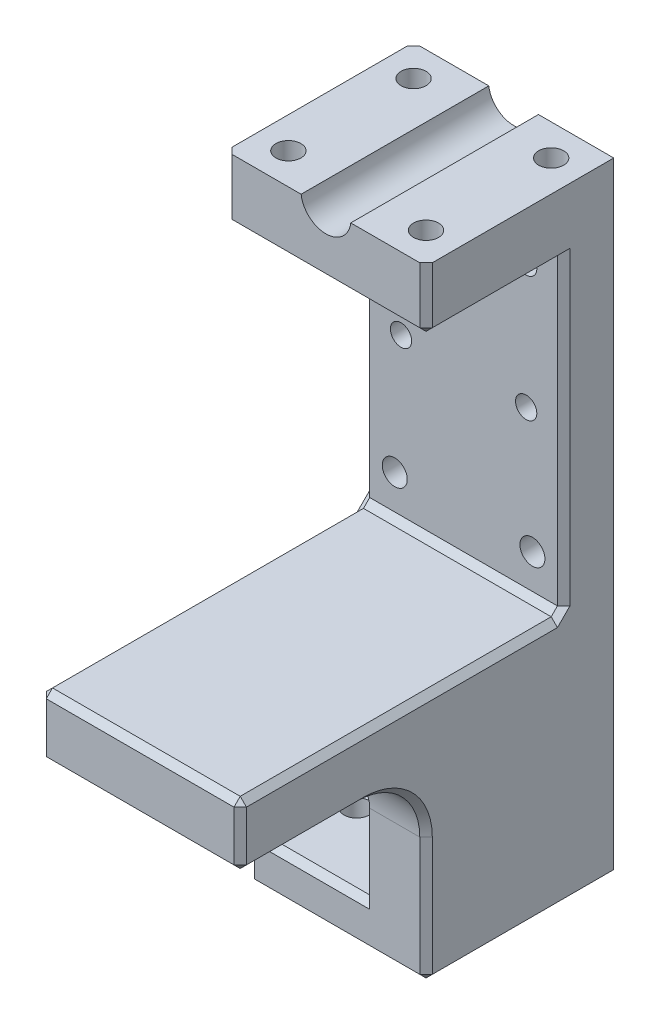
ISO-10303-21;
HEADER;
FILE_DESCRIPTION(('STEP AP214'),'2;1');
FILE_NAME('part.step','',(''),(''),'','','');
FILE_SCHEMA(('AUTOMOTIVE_DESIGN { 1 0 10303 214 1 1 1 1 }'));
ENDSEC;
DATA;
#1=APPLICATION_CONTEXT('core data for automotive mechanical design processes');
#2=APPLICATION_PROTOCOL_DEFINITION('international standard','automotive_design',2000,#1);
#3=PRODUCT_CONTEXT('',#1,'mechanical');
#4=PRODUCT('Part','Part','',(#3));
#5=PRODUCT_RELATED_PRODUCT_CATEGORY('part','',(#4));
#6=PRODUCT_DEFINITION_FORMATION('','',#4);
#7=PRODUCT_DEFINITION_CONTEXT('part definition',#1,'design');
#8=PRODUCT_DEFINITION('design','',#6,#7);
#9=PRODUCT_DEFINITION_SHAPE('','',#8);
#10=(LENGTH_UNIT() NAMED_UNIT(*) SI_UNIT(.MILLI.,.METRE.));
#11=(NAMED_UNIT(*) PLANE_ANGLE_UNIT() SI_UNIT($,.RADIAN.));
#12=(NAMED_UNIT(*) SI_UNIT($,.STERADIAN.) SOLID_ANGLE_UNIT());
#13=UNCERTAINTY_MEASURE_WITH_UNIT(LENGTH_MEASURE(1.E-05),#10,'distance_accuracy_value','');
#14=(GEOMETRIC_REPRESENTATION_CONTEXT(3) GLOBAL_UNCERTAINTY_ASSIGNED_CONTEXT((#13)) GLOBAL_UNIT_ASSIGNED_CONTEXT((#10,
#11,#12)) REPRESENTATION_CONTEXT('',''));
#15=CARTESIAN_POINT('',(0.,0.,0.));
#16=DIRECTION('',(0.,0.,1.));
#17=DIRECTION('',(1.,0.,0.));
#18=AXIS2_PLACEMENT_3D('',#15,#16,#17);
#19=CARTESIAN_POINT('',(16.,-29.,-30.));
#20=DIRECTION('',(1.,0.,0.));
#21=DIRECTION('',(0.,0.,-1.));
#22=AXIS2_PLACEMENT_3D('',#19,#20,#21);
#23=PLANE('',#22);
#24=DIRECTION('',(0.,0.,1.));
#25=VECTOR('',#24,1.);
#26=CARTESIAN_POINT('',(16.,29.,-30.));
#27=LINE('',#26,#25);
#28=CARTESIAN_POINT('',(16.,29.,-30.));
#29=VERTEX_POINT('',#28);
#30=CARTESIAN_POINT('',(16.,29.,-1.));
#31=VERTEX_POINT('',#30);
#32=EDGE_CURVE('E461',#29,#31,#27,.T.);
#33=ORIENTED_EDGE('',*,*,#32,.T.);
#34=DIRECTION('',(0.,-1.,0.));
#35=VECTOR('',#34,1.);
#36=CARTESIAN_POINT('',(16.,19.,-1.));
#37=LINE('',#36,#35);
#38=CARTESIAN_POINT('',(16.,20.,-1.));
#39=VERTEX_POINT('',#38);
#40=EDGE_CURVE('E497',#31,#39,#37,.T.);
#41=ORIENTED_EDGE('',*,*,#40,.T.);
#42=DIRECTION('',(0.,0.,-1.));
#43=VECTOR('',#42,1.);
#44=CARTESIAN_POINT('',(16.,20.,-22.));
#45=LINE('',#44,#43);
#46=CARTESIAN_POINT('',(16.,20.,-23.));
#47=VERTEX_POINT('',#46);
#48=EDGE_CURVE('E1033',#39,#47,#45,.T.);
#49=ORIENTED_EDGE('',*,*,#48,.T.);
#50=DIRECTION('',(0.,-1.,0.));
#51=VECTOR('',#50,1.);
#52=CARTESIAN_POINT('',(16.,-30.5,-23.));
#53=LINE('',#52,#51);
#54=CARTESIAN_POINT('',(16.,-29.5,-23.));
#55=VERTEX_POINT('',#54);
#56=EDGE_CURVE('E1036',#47,#55,#53,.T.);
#57=ORIENTED_EDGE('',*,*,#56,.T.);
#58=DIRECTION('',(0.,0.707106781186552,-0.707106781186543));
#59=VECTOR('',#58,1.);
#60=CARTESIAN_POINT('',(16.,-25.75,-26.7499999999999));
#61=LINE('',#60,#59);
#62=CARTESIAN_POINT('',(16.,-30.5,-22.));
#63=VERTEX_POINT('',#62);
#64=EDGE_CURVE('E1040',#63,#55,#61,.T.);
#65=ORIENTED_EDGE('',*,*,#64,.F.);
#66=DIRECTION('',(0.,0.707106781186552,-0.707106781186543));
#67=VECTOR('',#66,1.);
#68=CARTESIAN_POINT('',(16.,-25.75,-26.7499999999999));
#69=LINE('',#68,#67);
#70=CARTESIAN_POINT('',(16.,-31.5,-21.));
#71=VERTEX_POINT('',#70);
#72=EDGE_CURVE('E1046',#71,#63,#69,.T.);
#73=ORIENTED_EDGE('',*,*,#72,.F.);
#74=DIRECTION('',(0.,0.,1.));
#75=VECTOR('',#74,1.);
#76=CARTESIAN_POINT('',(16.,-31.5,29.7));
#77=LINE('',#76,#75);
#78=CARTESIAN_POINT('',(16.,-31.5,28.7));
#79=VERTEX_POINT('',#78);
#80=EDGE_CURVE('E1050',#71,#79,#77,.T.);
#81=ORIENTED_EDGE('',*,*,#80,.T.);
#82=DIRECTION('',(0.,-1.,0.));
#83=VECTOR('',#82,1.);
#84=CARTESIAN_POINT('',(16.,-40.5,28.7));
#85=LINE('',#84,#83);
#86=CARTESIAN_POINT('',(16.,-39.5,28.7));
#87=VERTEX_POINT('',#86);
#88=EDGE_CURVE('E1053',#79,#87,#85,.T.);
#89=ORIENTED_EDGE('',*,*,#88,.T.);
#90=DIRECTION('',(0.,0.,-1.));
#91=VECTOR('',#90,1.);
#92=CARTESIAN_POINT('',(16.,-39.5,-30.));
#93=LINE('',#92,#91);
#94=CARTESIAN_POINT('',(16.,-39.5,10.));
#95=VERTEX_POINT('',#94);
#96=EDGE_CURVE('E1056',#87,#95,#93,.T.);
#97=ORIENTED_EDGE('',*,*,#96,.T.);
#98=CARTESIAN_POINT('',(16.,-50.5,10.));
#99=DIRECTION('',(1.,0.,0.));
#100=DIRECTION('',(0.,0.,-1.));
#101=AXIS2_PLACEMENT_3D('',#98,#99,#100);
#102=CIRCLE('',#101,11.);
#103=CARTESIAN_POINT('',(16.,-50.5,-1.));
#104=VERTEX_POINT('',#103);
#105=EDGE_CURVE('E1059',#95,#104,#102,.F.);
#106=ORIENTED_EDGE('',*,*,#105,.T.);
#107=DIRECTION('',(0.,-1.,0.));
#108=VECTOR('',#107,1.);
#109=CARTESIAN_POINT('',(16.,-70.5,-1.));
#110=LINE('',#109,#108);
#111=CARTESIAN_POINT('',(16.,-69.5,-1.));
#112=VERTEX_POINT('',#111);
#113=EDGE_CURVE('E1062',#104,#112,#110,.T.);
#114=ORIENTED_EDGE('',*,*,#113,.T.);
#115=DIRECTION('',(0.,0.,-1.));
#116=VECTOR('',#115,1.);
#117=CARTESIAN_POINT('',(16.,-69.5,-30.));
#118=LINE('',#117,#116);
#119=CARTESIAN_POINT('',(16.,-69.5,-30.));
#120=VERTEX_POINT('',#119);
#121=EDGE_CURVE('E1065',#112,#120,#118,.T.);
#122=ORIENTED_EDGE('',*,*,#121,.T.);
#123=DIRECTION('',(0.,1.,0.));
#124=VECTOR('',#123,1.);
#125=CARTESIAN_POINT('',(16.,-29.,-30.));
#126=LINE('',#125,#124);
#127=EDGE_CURVE('E452',#120,#29,#126,.T.);
#128=ORIENTED_EDGE('',*,*,#127,.T.);
#129=EDGE_LOOP('',(#33,#41,#49,#57,#65,#73,#81,#89,#97,#106,#114,#122,#128));
#130=FACE_BOUND('',#129,.T.);
#131=ADVANCED_FACE('F40',(#130),#23,.T.);
#132=CARTESIAN_POINT('',(-16.,-29.,-30.));
#133=DIRECTION('',(-1.,0.,0.));
#134=DIRECTION('',(0.,0.,1.));
#135=AXIS2_PLACEMENT_3D('',#132,#133,#134);
#136=PLANE('',#135);
#137=DIRECTION('',(0.,0.,1.));
#138=VECTOR('',#137,1.);
#139=CARTESIAN_POINT('',(-16.,20.,0.));
#140=LINE('',#139,#138);
#141=CARTESIAN_POINT('',(-16.,20.,-23.));
#142=VERTEX_POINT('',#141);
#143=CARTESIAN_POINT('',(-16.,20.,-1.));
#144=VERTEX_POINT('',#143);
#145=EDGE_CURVE('E1089',#142,#144,#140,.T.);
#146=ORIENTED_EDGE('',*,*,#145,.T.);
#147=DIRECTION('',(0.,1.,0.));
#148=VECTOR('',#147,1.);
#149=CARTESIAN_POINT('',(-16.,29.,-1.));
#150=LINE('',#149,#148);
#151=CARTESIAN_POINT('',(-16.,29.,-1.));
#152=VERTEX_POINT('',#151);
#153=EDGE_CURVE('E1086',#144,#152,#150,.T.);
#154=ORIENTED_EDGE('',*,*,#153,.T.);
#155=DIRECTION('',(0.,0.,1.));
#156=VECTOR('',#155,1.);
#157=CARTESIAN_POINT('',(-16.,29.,-30.));
#158=LINE('',#157,#156);
#159=CARTESIAN_POINT('',(-16.,29.,-29.));
#160=VERTEX_POINT('',#159);
#161=EDGE_CURVE('E464',#160,#152,#158,.T.);
#162=ORIENTED_EDGE('',*,*,#161,.F.);
#163=DIRECTION('',(0.,-1.,0.));
#164=VECTOR('',#163,1.);
#165=CARTESIAN_POINT('',(-16.,-29.,-29.));
#166=LINE('',#165,#164);
#167=CARTESIAN_POINT('',(-16.,-39.5,-29.));
#168=VERTEX_POINT('',#167);
#169=EDGE_CURVE('E1103',#160,#168,#166,.T.);
#170=ORIENTED_EDGE('',*,*,#169,.T.);
#171=DIRECTION('',(0.,0.,1.));
#172=VECTOR('',#171,1.);
#173=CARTESIAN_POINT('',(-16.,-39.5,-30.));
#174=LINE('',#173,#172);
#175=CARTESIAN_POINT('',(-16.,-39.5,28.7));
#176=VERTEX_POINT('',#175);
#177=EDGE_CURVE('E1106',#168,#176,#174,.T.);
#178=ORIENTED_EDGE('',*,*,#177,.T.);
#179=DIRECTION('',(0.,1.,0.));
#180=VECTOR('',#179,1.);
#181=CARTESIAN_POINT('',(-16.,-30.5,28.7));
#182=LINE('',#181,#180);
#183=CARTESIAN_POINT('',(-16.,-31.5,28.7));
#184=VERTEX_POINT('',#183);
#185=EDGE_CURVE('E1112',#176,#184,#182,.T.);
#186=ORIENTED_EDGE('',*,*,#185,.T.);
#187=DIRECTION('',(0.,0.,-1.));
#188=VECTOR('',#187,1.);
#189=CARTESIAN_POINT('',(-16.,-31.5,-22.));
#190=LINE('',#189,#188);
#191=CARTESIAN_POINT('',(-16.,-31.5,-21.));
#192=VERTEX_POINT('',#191);
#193=EDGE_CURVE('E1109',#184,#192,#190,.T.);
#194=ORIENTED_EDGE('',*,*,#193,.T.);
#195=DIRECTION('',(0.,-0.707106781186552,0.707106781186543));
#196=VECTOR('',#195,1.);
#197=CARTESIAN_POINT('',(-16.,-25.75,-26.7499999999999));
#198=LINE('',#197,#196);
#199=CARTESIAN_POINT('',(-16.,-30.5,-22.));
#200=VERTEX_POINT('',#199);
#201=EDGE_CURVE('E1099',#200,#192,#198,.T.);
#202=ORIENTED_EDGE('',*,*,#201,.F.);
#203=DIRECTION('',(0.,-0.707106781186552,0.707106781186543));
#204=VECTOR('',#203,1.);
#205=CARTESIAN_POINT('',(-16.,-25.75,-26.7499999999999));
#206=LINE('',#205,#204);
#207=CARTESIAN_POINT('',(-16.,-29.5,-23.));
#208=VERTEX_POINT('',#207);
#209=EDGE_CURVE('E1095',#208,#200,#206,.T.);
#210=ORIENTED_EDGE('',*,*,#209,.F.);
#211=DIRECTION('',(0.,1.,0.));
#212=VECTOR('',#211,1.);
#213=CARTESIAN_POINT('',(-16.,19.,-23.));
#214=LINE('',#213,#212);
#215=EDGE_CURVE('E1092',#208,#142,#214,.T.);
#216=ORIENTED_EDGE('',*,*,#215,.T.);
#217=EDGE_LOOP('',(#146,#154,#162,#170,#178,#186,#194,#202,#210,#216));
#218=FACE_BOUND('',#217,.T.);
#219=ADVANCED_FACE('F1015',(#218),#136,.T.);
#220=CARTESIAN_POINT('',(6.,-70.5,-30.));
#221=DIRECTION('',(1.,0.,0.));
#222=DIRECTION('',(0.,0.,-1.));
#223=AXIS2_PLACEMENT_3D('',#220,#221,#222);
#224=PLANE('',#223);
#225=DIRECTION('',(0.,0.,-1.));
#226=VECTOR('',#225,1.);
#227=CARTESIAN_POINT('',(6.,-63.5,-30.));
#228=LINE('',#227,#226);
#229=CARTESIAN_POINT('',(6.,-63.5,-0.999999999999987));
#230=VERTEX_POINT('',#229);
#231=CARTESIAN_POINT('',(6.,-63.5,-30.));
#232=VERTEX_POINT('',#231);
#233=EDGE_CURVE('E275',#230,#232,#228,.T.);
#234=ORIENTED_EDGE('',*,*,#233,.F.);
#235=DIRECTION('',(0.,1.,0.));
#236=VECTOR('',#235,1.);
#237=CARTESIAN_POINT('',(6.,-70.5,-0.999999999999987));
#238=LINE('',#237,#236);
#239=CARTESIAN_POINT('',(6.,-50.5,-0.999999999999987));
#240=VERTEX_POINT('',#239);
#241=EDGE_CURVE('E11',#230,#240,#238,.T.);
#242=ORIENTED_EDGE('',*,*,#241,.T.);
#243=DIRECTION('',(0.,0.,-1.));
#244=VECTOR('',#243,1.);
#245=CARTESIAN_POINT('',(6.,-50.5,-30.));
#246=LINE('',#245,#244);
#247=CARTESIAN_POINT('',(6.,-50.5,-30.));
#248=VERTEX_POINT('',#247);
#249=EDGE_CURVE('E302',#240,#248,#246,.T.);
#250=ORIENTED_EDGE('',*,*,#249,.T.);
#251=DIRECTION('',(0.,1.,0.));
#252=VECTOR('',#251,1.);
#253=CARTESIAN_POINT('',(6.,-70.5,-30.));
#254=LINE('',#253,#252);
#255=EDGE_CURVE('E292',#232,#248,#254,.T.);
#256=ORIENTED_EDGE('',*,*,#255,.F.);
#257=EDGE_LOOP('',(#234,#242,#250,#256));
#258=FACE_BOUND('',#257,.T.);
#259=ADVANCED_FACE('F300',(#258),#224,.F.);
#260=CARTESIAN_POINT('',(-16.,-29.,-22.));
#261=DIRECTION('',(0.,0.,-1.));
#262=DIRECTION('',(-1.,0.,0.));
#263=AXIS2_PLACEMENT_3D('',#260,#261,#262);
#264=PLANE('',#263);
#265=CARTESIAN_POINT('',(10.,15.5,-22.));
#266=DIRECTION('',(0.,0.,-1.));
#267=DIRECTION('',(-1.,0.,0.));
#268=AXIS2_PLACEMENT_3D('',#265,#266,#267);
#269=CIRCLE('',#268,1.7);
#270=CARTESIAN_POINT('',(8.3,15.5,-22.));
#271=VERTEX_POINT('',#270);
#272=EDGE_CURVE('E446',#271,#271,#269,.T.);
#273=ORIENTED_EDGE('',*,*,#272,.T.);
#274=EDGE_LOOP('',(#273));
#275=FACE_BOUND('',#274,.T.);
#276=CARTESIAN_POINT('',(-10.,15.5,-22.));
#277=DIRECTION('',(0.,0.,-1.));
#278=DIRECTION('',(-1.,0.,0.));
#279=AXIS2_PLACEMENT_3D('',#276,#277,#278);
#280=CIRCLE('',#279,1.7);
#281=CARTESIAN_POINT('',(-11.7,15.5,-22.));
#282=VERTEX_POINT('',#281);
#283=EDGE_CURVE('E433',#282,#282,#280,.T.);
#284=ORIENTED_EDGE('',*,*,#283,.T.);
#285=EDGE_LOOP('',(#284));
#286=FACE_BOUND('',#285,.T.);
#287=CARTESIAN_POINT('',(10.,-4.5,-22.));
#288=DIRECTION('',(0.,0.,-1.));
#289=DIRECTION('',(-1.,0.,0.));
#290=AXIS2_PLACEMENT_3D('',#287,#288,#289);
#291=CIRCLE('',#290,1.7);
#292=CARTESIAN_POINT('',(8.3,-4.5,-22.));
#293=VERTEX_POINT('',#292);
#294=EDGE_CURVE('E420',#293,#293,#291,.T.);
#295=ORIENTED_EDGE('',*,*,#294,.T.);
#296=EDGE_LOOP('',(#295));
#297=FACE_BOUND('',#296,.T.);
#298=CARTESIAN_POINT('',(-10.,-4.5,-22.));
#299=DIRECTION('',(0.,0.,-1.));
#300=DIRECTION('',(-1.,0.,0.));
#301=AXIS2_PLACEMENT_3D('',#298,#299,#300);
#302=CIRCLE('',#301,1.7);
#303=CARTESIAN_POINT('',(-11.7,-4.5,-22.));
#304=VERTEX_POINT('',#303);
#305=EDGE_CURVE('E407',#304,#304,#302,.T.);
#306=ORIENTED_EDGE('',*,*,#305,.T.);
#307=EDGE_LOOP('',(#306));
#308=FACE_BOUND('',#307,.T.);
#309=CARTESIAN_POINT('',(11.,-24.,-22.));
#310=DIRECTION('',(0.,0.,-1.));
#311=DIRECTION('',(-1.,0.,0.));
#312=AXIS2_PLACEMENT_3D('',#309,#310,#311);
#313=CIRCLE('',#312,1.99999999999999);
#314=CARTESIAN_POINT('',(9.00000000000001,-24.,-22.));
#315=VERTEX_POINT('',#314);
#316=EDGE_CURVE('E391',#315,#315,#313,.T.);
#317=ORIENTED_EDGE('',*,*,#316,.T.);
#318=EDGE_LOOP('',(#317));
#319=FACE_BOUND('',#318,.T.);
#320=CARTESIAN_POINT('',(-11.,-24.,-22.));
#321=DIRECTION('',(0.,0.,-1.));
#322=DIRECTION('',(-1.,0.,0.));
#323=AXIS2_PLACEMENT_3D('',#320,#321,#322);
#324=CIRCLE('',#323,1.99999999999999);
#325=CARTESIAN_POINT('',(-13.,-24.,-22.));
#326=VERTEX_POINT('',#325);
#327=EDGE_CURVE('E386',#326,#326,#324,.T.);
#328=ORIENTED_EDGE('',*,*,#327,.T.);
#329=EDGE_LOOP('',(#328));
#330=FACE_BOUND('',#329,.T.);
#331=DIRECTION('',(1.,0.,0.));
#332=VECTOR('',#331,1.);
#333=CARTESIAN_POINT('',(16.,-29.5,-22.));
#334=LINE('',#333,#332);
#335=CARTESIAN_POINT('',(-15.,-29.5,-22.));
#336=VERTEX_POINT('',#335);
#337=CARTESIAN_POINT('',(15.,-29.5,-22.));
#338=VERTEX_POINT('',#337);
#339=EDGE_CURVE('E516',#336,#338,#334,.T.);
#340=ORIENTED_EDGE('',*,*,#339,.T.);
#341=DIRECTION('',(0.,1.,0.));
#342=VECTOR('',#341,1.);
#343=CARTESIAN_POINT('',(15.,19.,-22.));
#344=LINE('',#343,#342);
#345=CARTESIAN_POINT('',(15.,19.,-22.));
#346=VERTEX_POINT('',#345);
#347=EDGE_CURVE('E522',#338,#346,#344,.T.);
#348=ORIENTED_EDGE('',*,*,#347,.T.);
#349=DIRECTION('',(1.,0.,0.));
#350=VECTOR('',#349,1.);
#351=CARTESIAN_POINT('',(-16.,19.,-22.));
#352=LINE('',#351,#350);
#353=CARTESIAN_POINT('',(-15.,19.,-22.));
#354=VERTEX_POINT('',#353);
#355=EDGE_CURVE('E447',#354,#346,#352,.T.);
#356=ORIENTED_EDGE('',*,*,#355,.F.);
#357=DIRECTION('',(0.,-1.,0.));
#358=VECTOR('',#357,1.);
#359=CARTESIAN_POINT('',(-15.,-30.5,-22.));
#360=LINE('',#359,#358);
#361=EDGE_CURVE('E519',#354,#336,#360,.T.);
#362=ORIENTED_EDGE('',*,*,#361,.T.);
#363=EDGE_LOOP('',(#340,#348,#356,#362));
#364=FACE_BOUND('',#363,.T.);
#365=ADVANCED_FACE('F1402',(#275,#286,#297,#308,#319,#330,#364),#264,.F.);
#366=CARTESIAN_POINT('',(-16.,29.,-30.));
#367=DIRECTION('',(0.,1.,0.));
#368=DIRECTION('',(0.,0.,1.));
#369=AXIS2_PLACEMENT_3D('',#366,#367,#368);
#370=PLANE('',#369);
#371=CARTESIAN_POINT('',(11.,29.,-25.));
#372=DIRECTION('',(0.,1.,0.));
#373=DIRECTION('',(0.,0.,1.));
#374=AXIS2_PLACEMENT_3D('',#371,#372,#373);
#375=CIRCLE('',#374,2.);
#376=CARTESIAN_POINT('',(11.,29.,-23.));
#377=VERTEX_POINT('',#376);
#378=EDGE_CURVE('E345',#377,#377,#375,.T.);
#379=ORIENTED_EDGE('',*,*,#378,.F.);
#380=EDGE_LOOP('',(#379));
#381=FACE_BOUND('',#380,.T.);
#382=CARTESIAN_POINT('',(11.,29.,-5.));
#383=DIRECTION('',(0.,1.,0.));
#384=DIRECTION('',(0.,0.,1.));
#385=AXIS2_PLACEMENT_3D('',#382,#383,#384);
#386=CIRCLE('',#385,2.);
#387=CARTESIAN_POINT('',(11.,29.,-3.));
#388=VERTEX_POINT('',#387);
#389=EDGE_CURVE('E353',#388,#388,#386,.T.);
#390=ORIENTED_EDGE('',*,*,#389,.F.);
#391=EDGE_LOOP('',(#390));
#392=FACE_BOUND('',#391,.T.);
#393=DIRECTION('',(-1.,0.,0.));
#394=VECTOR('',#393,1.);
#395=CARTESIAN_POINT('',(-16.,29.,0.));
#396=LINE('',#395,#394);
#397=CARTESIAN_POINT('',(15.,29.,0.));
#398=VERTEX_POINT('',#397);
#399=CARTESIAN_POINT('',(3.96862696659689,29.,0.));
#400=VERTEX_POINT('',#399);
#401=EDGE_CURVE('E456',#398,#400,#396,.T.);
#402=ORIENTED_EDGE('',*,*,#401,.F.);
#403=DIRECTION('',(0.707106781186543,0.,-0.707106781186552));
#404=VECTOR('',#403,1.);
#405=CARTESIAN_POINT('',(14.5000000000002,29.,0.499999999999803));
#406=LINE('',#405,#404);
#407=EDGE_CURVE('E1031',#398,#31,#406,.T.);
#408=ORIENTED_EDGE('',*,*,#407,.T.);
#409=ORIENTED_EDGE('',*,*,#32,.F.);
#410=DIRECTION('',(-1.,0.,0.));
#411=VECTOR('',#410,1.);
#412=CARTESIAN_POINT('',(-16.,29.,-30.));
#413=LINE('',#412,#411);
#414=CARTESIAN_POINT('',(3.96862696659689,29.,-30.));
#415=VERTEX_POINT('',#414);
#416=EDGE_CURVE('E457',#29,#415,#413,.T.);
#417=ORIENTED_EDGE('',*,*,#416,.T.);
#418=DIRECTION('',(0.,0.,-1.));
#419=VECTOR('',#418,1.);
#420=CARTESIAN_POINT('',(3.96862696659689,29.,0.));
#421=LINE('',#420,#419);
#422=EDGE_CURVE('E379',#400,#415,#421,.T.);
#423=ORIENTED_EDGE('',*,*,#422,.F.);
#424=EDGE_LOOP('',(#402,#408,#409,#417,#423));
#425=FACE_BOUND('',#424,.T.);
#426=ADVANCED_FACE('F1329',(#381,#392,#425),#370,.T.);
#427=CARTESIAN_POINT('',(-11.,29.,-25.));
#428=DIRECTION('',(0.,1.,0.));
#429=DIRECTION('',(0.,0.,1.));
#430=AXIS2_PLACEMENT_3D('',#427,#428,#429);
#431=CIRCLE('',#430,2.);
#432=CARTESIAN_POINT('',(-11.,29.,-23.));
#433=VERTEX_POINT('',#432);
#434=EDGE_CURVE('E337',#433,#433,#431,.T.);
#435=ORIENTED_EDGE('',*,*,#434,.F.);
#436=EDGE_LOOP('',(#435));
#437=FACE_BOUND('',#436,.T.);
#438=CARTESIAN_POINT('',(-11.,29.,-5.));
#439=DIRECTION('',(0.,1.,0.));
#440=DIRECTION('',(0.,0.,1.));
#441=AXIS2_PLACEMENT_3D('',#438,#439,#440);
#442=CIRCLE('',#441,2.);
#443=CARTESIAN_POINT('',(-11.,29.,-3.));
#444=VERTEX_POINT('',#443);
#445=EDGE_CURVE('E361',#444,#444,#442,.T.);
#446=ORIENTED_EDGE('',*,*,#445,.F.);
#447=EDGE_LOOP('',(#446));
#448=FACE_BOUND('',#447,.T.);
#449=ORIENTED_EDGE('',*,*,#161,.T.);
#450=DIRECTION('',(0.707106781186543,0.,0.707106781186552));
#451=VECTOR('',#450,1.);
#452=CARTESIAN_POINT('',(-30.5,29.,-15.5000000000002));
#453=LINE('',#452,#451);
#454=CARTESIAN_POINT('',(-15.,29.,0.));
#455=VERTEX_POINT('',#454);
#456=EDGE_CURVE('E1080',#152,#455,#453,.T.);
#457=ORIENTED_EDGE('',*,*,#456,.T.);
#458=CARTESIAN_POINT('',(-3.96862696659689,29.,0.));
#459=VERTEX_POINT('',#458);
#460=EDGE_CURVE('E451',#459,#455,#396,.T.);
#461=ORIENTED_EDGE('',*,*,#460,.F.);
#462=DIRECTION('',(0.,0.,-1.));
#463=VECTOR('',#462,1.);
#464=CARTESIAN_POINT('',(-3.96862696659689,29.,0.));
#465=LINE('',#464,#463);
#466=CARTESIAN_POINT('',(-3.96862696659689,29.,-30.));
#467=VERTEX_POINT('',#466);
#468=EDGE_CURVE('E374',#467,#459,#465,.F.);
#469=ORIENTED_EDGE('',*,*,#468,.F.);
#470=CARTESIAN_POINT('',(-15.,29.,-30.));
#471=VERTEX_POINT('',#470);
#472=EDGE_CURVE('E455',#467,#471,#413,.T.);
#473=ORIENTED_EDGE('',*,*,#472,.T.);
#474=DIRECTION('',(0.707106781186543,0.,-0.707106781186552));
#475=VECTOR('',#474,1.);
#476=CARTESIAN_POINT('',(-15.5,29.,-29.5));
#477=LINE('',#476,#475);
#478=EDGE_CURVE('E1083',#471,#160,#477,.F.);
#479=ORIENTED_EDGE('',*,*,#478,.T.);
#480=EDGE_LOOP('',(#449,#457,#461,#469,#473,#479));
#481=FACE_BOUND('',#480,.T.);
#482=ADVANCED_FACE('F1265',(#437,#448,#481),#370,.T.);
#483=CARTESIAN_POINT('',(0.,0.,-30.));
#484=DIRECTION('',(0.,0.,-1.));
#485=DIRECTION('',(-1.,0.,0.));
#486=AXIS2_PLACEMENT_3D('',#483,#484,#485);
#487=PLANE('',#486);
#488=DIRECTION('',(1.,0.,0.));
#489=VECTOR('',#488,1.);
#490=CARTESIAN_POINT('',(-16.,-40.5,-30.));
#491=LINE('',#490,#489);
#492=CARTESIAN_POINT('',(-15.,-40.5,-30.));
#493=VERTEX_POINT('',#492);
#494=CARTESIAN_POINT('',(-4.,-40.5,-30.));
#495=VERTEX_POINT('',#494);
#496=EDGE_CURVE('E334',#493,#495,#491,.T.);
#497=ORIENTED_EDGE('',*,*,#496,.F.);
#498=DIRECTION('',(0.,1.,0.));
#499=VECTOR('',#498,1.);
#500=CARTESIAN_POINT('',(-15.,0.,-30.));
#501=LINE('',#500,#499);
#502=EDGE_CURVE('E1153',#493,#471,#501,.T.);
#503=ORIENTED_EDGE('',*,*,#502,.T.);
#504=ORIENTED_EDGE('',*,*,#472,.F.);
#505=CARTESIAN_POINT('',(0.,29.5,-30.));
#506=DIRECTION('',(0.,0.,-1.));
#507=DIRECTION('',(-1.,0.,0.));
#508=AXIS2_PLACEMENT_3D('',#505,#506,#507);
#509=CIRCLE('',#508,4.);
#510=EDGE_CURVE('E369',#415,#467,#509,.T.);
#511=ORIENTED_EDGE('',*,*,#510,.F.);
#512=ORIENTED_EDGE('',*,*,#416,.F.);
#513=ORIENTED_EDGE('',*,*,#127,.F.);
#514=DIRECTION('',(0.707106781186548,0.707106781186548,0.));
#515=VECTOR('',#514,1.);
#516=CARTESIAN_POINT('',(42.75,-42.75,-30.));
#517=LINE('',#516,#515);
#518=CARTESIAN_POINT('',(15.,-70.5,-30.));
#519=VERTEX_POINT('',#518);
#520=EDGE_CURVE('E1156',#120,#519,#517,.F.);
#521=ORIENTED_EDGE('',*,*,#520,.T.);
#522=DIRECTION('',(1.,0.,0.));
#523=VECTOR('',#522,1.);
#524=CARTESIAN_POINT('',(16.,-70.5,-30.));
#525=LINE('',#524,#523);
#526=CARTESIAN_POINT('',(-11.4,-70.5,-30.));
#527=VERTEX_POINT('',#526);
#528=EDGE_CURVE('E298',#527,#519,#525,.T.);
#529=ORIENTED_EDGE('',*,*,#528,.F.);
#530=DIRECTION('',(-0.707106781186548,0.707106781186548,0.));
#531=VECTOR('',#530,1.);
#532=CARTESIAN_POINT('',(-40.95,-40.95,-30.));
#533=LINE('',#532,#531);
#534=CARTESIAN_POINT('',(-12.4,-69.5,-30.));
#535=VERTEX_POINT('',#534);
#536=EDGE_CURVE('E1161',#527,#535,#533,.T.);
#537=ORIENTED_EDGE('',*,*,#536,.T.);
#538=DIRECTION('',(0.,-1.,0.));
#539=VECTOR('',#538,1.);
#540=CARTESIAN_POINT('',(-12.4,-70.5,-30.));
#541=LINE('',#540,#539);
#542=CARTESIAN_POINT('',(-12.4,-64.5,-30.));
#543=VERTEX_POINT('',#542);
#544=EDGE_CURVE('E283',#543,#535,#541,.T.);
#545=ORIENTED_EDGE('',*,*,#544,.F.);
#546=DIRECTION('',(-0.707106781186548,-0.707106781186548,0.));
#547=VECTOR('',#546,1.);
#548=CARTESIAN_POINT('',(26.05,-26.05,-30.));
#549=LINE('',#548,#547);
#550=CARTESIAN_POINT('',(-11.4,-63.5,-30.));
#551=VERTEX_POINT('',#550);
#552=EDGE_CURVE('E296',#543,#551,#549,.F.);
#553=ORIENTED_EDGE('',*,*,#552,.T.);
#554=DIRECTION('',(1.,0.,0.));
#555=VECTOR('',#554,1.);
#556=CARTESIAN_POINT('',(-12.4,-63.5,-30.));
#557=LINE('',#556,#555);
#558=EDGE_CURVE('E278',#551,#232,#557,.T.);
#559=ORIENTED_EDGE('',*,*,#558,.T.);
#560=ORIENTED_EDGE('',*,*,#255,.T.);
#561=CARTESIAN_POINT('',(-4.,-50.5,-30.));
#562=DIRECTION('',(0.,0.,-1.));
#563=DIRECTION('',(-1.,0.,0.));
#564=AXIS2_PLACEMENT_3D('',#561,#562,#563);
#565=CIRCLE('',#564,10.);
#566=EDGE_CURVE('E1125',#248,#495,#565,.F.);
#567=ORIENTED_EDGE('',*,*,#566,.T.);
#568=EDGE_LOOP('',(#497,#503,#504,#511,#512,#513,#521,#529,#537,#545,#553,#559,#560,#567));
#569=FACE_BOUND('',#568,.T.);
#570=CARTESIAN_POINT('',(-11.,-24.,-30.));
#571=DIRECTION('',(0.,0.,-1.));
#572=DIRECTION('',(-1.,0.,0.));
#573=AXIS2_PLACEMENT_3D('',#570,#571,#572);
#574=CIRCLE('',#573,2.);
#575=CARTESIAN_POINT('',(-13.,-24.,-30.));
#576=VERTEX_POINT('',#575);
#577=EDGE_CURVE('E382',#576,#576,#574,.T.);
#578=ORIENTED_EDGE('',*,*,#577,.F.);
#579=EDGE_LOOP('',(#578));
#580=FACE_BOUND('',#579,.T.);
#581=CARTESIAN_POINT('',(11.,-24.,-30.));
#582=DIRECTION('',(0.,0.,-1.));
#583=DIRECTION('',(-1.,0.,0.));
#584=AXIS2_PLACEMENT_3D('',#581,#582,#583);
#585=CIRCLE('',#584,2.);
#586=CARTESIAN_POINT('',(9.,-24.,-30.));
#587=VERTEX_POINT('',#586);
#588=EDGE_CURVE('E387',#587,#587,#585,.T.);
#589=ORIENTED_EDGE('',*,*,#588,.F.);
#590=EDGE_LOOP('',(#589));
#591=FACE_BOUND('',#590,.T.);
#592=CARTESIAN_POINT('',(-10.,-4.5,-30.));
#593=DIRECTION('',(0.,0.,-1.));
#594=DIRECTION('',(-1.,0.,0.));
#595=AXIS2_PLACEMENT_3D('',#592,#593,#594);
#596=CIRCLE('',#595,3.5);
#597=CARTESIAN_POINT('',(-13.5,-4.5,-30.));
#598=VERTEX_POINT('',#597);
#599=EDGE_CURVE('E395',#598,#598,#596,.T.);
#600=ORIENTED_EDGE('',*,*,#599,.F.);
#601=EDGE_LOOP('',(#600));
#602=FACE_BOUND('',#601,.T.);
#603=CARTESIAN_POINT('',(10.,-4.5,-30.));
#604=DIRECTION('',(0.,0.,-1.));
#605=DIRECTION('',(-1.,0.,0.));
#606=AXIS2_PLACEMENT_3D('',#603,#604,#605);
#607=CIRCLE('',#606,3.5);
#608=CARTESIAN_POINT('',(6.5,-4.5,-30.));
#609=VERTEX_POINT('',#608);
#610=EDGE_CURVE('E408',#609,#609,#607,.T.);
#611=ORIENTED_EDGE('',*,*,#610,.F.);
#612=EDGE_LOOP('',(#611));
#613=FACE_BOUND('',#612,.T.);
#614=CARTESIAN_POINT('',(-10.,15.5,-30.));
#615=DIRECTION('',(0.,0.,-1.));
#616=DIRECTION('',(-1.,0.,0.));
#617=AXIS2_PLACEMENT_3D('',#614,#615,#616);
#618=CIRCLE('',#617,3.5);
#619=CARTESIAN_POINT('',(-13.5,15.5,-30.));
#620=VERTEX_POINT('',#619);
#621=EDGE_CURVE('E421',#620,#620,#618,.T.);
#622=ORIENTED_EDGE('',*,*,#621,.F.);
#623=EDGE_LOOP('',(#622));
#624=FACE_BOUND('',#623,.T.);
#625=CARTESIAN_POINT('',(10.,15.5,-30.));
#626=DIRECTION('',(0.,0.,-1.));
#627=DIRECTION('',(-1.,0.,0.));
#628=AXIS2_PLACEMENT_3D('',#625,#626,#627);
#629=CIRCLE('',#628,3.5);
#630=CARTESIAN_POINT('',(6.5,15.5,-30.));
#631=VERTEX_POINT('',#630);
#632=EDGE_CURVE('E434',#631,#631,#629,.T.);
#633=ORIENTED_EDGE('',*,*,#632,.F.);
#634=EDGE_LOOP('',(#633));
#635=FACE_BOUND('',#634,.T.);
#636=ADVANCED_FACE('F289',(#569,#580,#591,#602,#613,#624,#635),#487,.T.);
#637=CARTESIAN_POINT('',(0.,0.,0.));
#638=DIRECTION('',(0.,0.,-1.));
#639=DIRECTION('',(-1.,0.,0.));
#640=AXIS2_PLACEMENT_3D('',#637,#638,#639);
#641=PLANE('',#640);
#642=ORIENTED_EDGE('',*,*,#460,.T.);
#643=DIRECTION('',(0.,-1.,0.));
#644=VECTOR('',#643,1.);
#645=CARTESIAN_POINT('',(-15.,19.,0.));
#646=LINE('',#645,#644);
#647=CARTESIAN_POINT('',(-15.,20.,0.));
#648=VERTEX_POINT('',#647);
#649=EDGE_CURVE('E1115',#455,#648,#646,.T.);
#650=ORIENTED_EDGE('',*,*,#649,.T.);
#651=DIRECTION('',(1.,0.,0.));
#652=VECTOR('',#651,1.);
#653=CARTESIAN_POINT('',(0.,20.,0.));
#654=LINE('',#653,#652);
#655=CARTESIAN_POINT('',(15.,20.,0.));
#656=VERTEX_POINT('',#655);
#657=EDGE_CURVE('E1119',#648,#656,#654,.T.);
#658=ORIENTED_EDGE('',*,*,#657,.T.);
#659=DIRECTION('',(0.,1.,0.));
#660=VECTOR('',#659,1.);
#661=CARTESIAN_POINT('',(15.,29.,0.));
#662=LINE('',#661,#660);
#663=EDGE_CURVE('E1122',#656,#398,#662,.T.);
#664=ORIENTED_EDGE('',*,*,#663,.T.);
#665=ORIENTED_EDGE('',*,*,#401,.T.);
#666=CARTESIAN_POINT('',(0.,29.5,0.));
#667=DIRECTION('',(0.,0.,-1.));
#668=DIRECTION('',(-1.,0.,0.));
#669=AXIS2_PLACEMENT_3D('',#666,#667,#668);
#670=CIRCLE('',#669,4.);
#671=EDGE_CURVE('E370',#400,#459,#670,.T.);
#672=ORIENTED_EDGE('',*,*,#671,.T.);
#673=EDGE_LOOP('',(#642,#650,#658,#664,#665,#672));
#674=FACE_BOUND('',#673,.T.);
#675=ADVANCED_FACE('F1271',(#674),#641,.F.);
#676=CARTESIAN_POINT('',(-16.,19.,-22.));
#677=DIRECTION('',(0.,1.,0.));
#678=DIRECTION('',(0.,0.,1.));
#679=AXIS2_PLACEMENT_3D('',#676,#677,#678);
#680=PLANE('',#679);
#681=DIRECTION('',(-1.,0.,0.));
#682=VECTOR('',#681,1.);
#683=CARTESIAN_POINT('',(-16.,19.,-0.999999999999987));
#684=LINE('',#683,#682);
#685=CARTESIAN_POINT('',(15.,19.,-0.999999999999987));
#686=VERTEX_POINT('',#685);
#687=CARTESIAN_POINT('',(-15.,19.,-0.999999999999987));
#688=VERTEX_POINT('',#687);
#689=EDGE_CURVE('E1074',#686,#688,#684,.T.);
#690=ORIENTED_EDGE('',*,*,#689,.T.);
#691=DIRECTION('',(0.,0.,-1.));
#692=VECTOR('',#691,1.);
#693=CARTESIAN_POINT('',(-15.,19.,-22.));
#694=LINE('',#693,#692);
#695=EDGE_CURVE('E1070',#688,#354,#694,.T.);
#696=ORIENTED_EDGE('',*,*,#695,.T.);
#697=ORIENTED_EDGE('',*,*,#355,.T.);
#698=DIRECTION('',(0.,0.,1.));
#699=VECTOR('',#698,1.);
#700=CARTESIAN_POINT('',(15.,19.,0.));
#701=LINE('',#700,#699);
#702=EDGE_CURVE('E1077',#346,#686,#701,.T.);
#703=ORIENTED_EDGE('',*,*,#702,.T.);
#704=EDGE_LOOP('',(#690,#696,#697,#703));
#705=FACE_BOUND('',#704,.T.);
#706=ADVANCED_FACE('F1397',(#705),#680,.F.);
#707=CARTESIAN_POINT('',(10.,15.5,-30.));
#708=DIRECTION('',(0.,0.,-1.));
#709=DIRECTION('',(-1.,0.,0.));
#710=AXIS2_PLACEMENT_3D('',#707,#708,#709);
#711=CYLINDRICAL_SURFACE('',#710,1.7);
#712=CARTESIAN_POINT('',(10.,15.5,-27.6));
#713=DIRECTION('',(0.,0.,-1.));
#714=DIRECTION('',(-1.,0.,0.));
#715=AXIS2_PLACEMENT_3D('',#712,#713,#714);
#716=CIRCLE('',#715,1.7);
#717=CARTESIAN_POINT('',(8.3,15.5,-27.6));
#718=VERTEX_POINT('',#717);
#719=EDGE_CURVE('E442',#718,#718,#716,.T.);
#720=ORIENTED_EDGE('',*,*,#719,.T.);
#721=EDGE_LOOP('',(#720));
#722=FACE_BOUND('',#721,.T.);
#723=ORIENTED_EDGE('',*,*,#272,.F.);
#724=EDGE_LOOP('',(#723));
#725=FACE_BOUND('',#724,.T.);
#726=ADVANCED_FACE('F1393',(#722,#725),#711,.F.);
#727=CARTESIAN_POINT('',(11.7,15.5,-27.6));
#728=DIRECTION('',(0.,0.,1.));
#729=DIRECTION('',(1.,0.,0.));
#730=AXIS2_PLACEMENT_3D('',#727,#728,#729);
#731=PLANE('',#730);
#732=ORIENTED_EDGE('',*,*,#719,.F.);
#733=EDGE_LOOP('',(#732));
#734=FACE_BOUND('',#733,.T.);
#735=CARTESIAN_POINT('',(10.,15.5,-27.6));
#736=DIRECTION('',(0.,0.,-1.));
#737=DIRECTION('',(-1.,0.,0.));
#738=AXIS2_PLACEMENT_3D('',#735,#736,#737);
#739=CIRCLE('',#738,3.5);
#740=CARTESIAN_POINT('',(6.5,15.5,-27.6));
#741=VERTEX_POINT('',#740);
#742=EDGE_CURVE('E438',#741,#741,#739,.T.);
#743=ORIENTED_EDGE('',*,*,#742,.T.);
#744=EDGE_LOOP('',(#743));
#745=FACE_BOUND('',#744,.T.);
#746=ADVANCED_FACE('F1389',(#734,#745),#731,.F.);
#747=CARTESIAN_POINT('',(10.,15.5,-30.));
#748=DIRECTION('',(0.,0.,-1.));
#749=DIRECTION('',(-1.,0.,0.));
#750=AXIS2_PLACEMENT_3D('',#747,#748,#749);
#751=CYLINDRICAL_SURFACE('',#750,3.5);
#752=ORIENTED_EDGE('',*,*,#742,.F.);
#753=EDGE_LOOP('',(#752));
#754=FACE_BOUND('',#753,.T.);
#755=ORIENTED_EDGE('',*,*,#632,.T.);
#756=EDGE_LOOP('',(#755));
#757=FACE_BOUND('',#756,.T.);
#758=ADVANCED_FACE('F1385',(#754,#757),#751,.F.);
#759=CARTESIAN_POINT('',(-10.,15.5,-30.));
#760=DIRECTION('',(0.,0.,-1.));
#761=DIRECTION('',(-1.,0.,0.));
#762=AXIS2_PLACEMENT_3D('',#759,#760,#761);
#763=CYLINDRICAL_SURFACE('',#762,1.7);
#764=CARTESIAN_POINT('',(-10.,15.5,-27.6));
#765=DIRECTION('',(0.,0.,-1.));
#766=DIRECTION('',(-1.,0.,0.));
#767=AXIS2_PLACEMENT_3D('',#764,#765,#766);
#768=CIRCLE('',#767,1.7);
#769=CARTESIAN_POINT('',(-11.7,15.5,-27.6));
#770=VERTEX_POINT('',#769);
#771=EDGE_CURVE('E429',#770,#770,#768,.T.);
#772=ORIENTED_EDGE('',*,*,#771,.T.);
#773=EDGE_LOOP('',(#772));
#774=FACE_BOUND('',#773,.T.);
#775=ORIENTED_EDGE('',*,*,#283,.F.);
#776=EDGE_LOOP('',(#775));
#777=FACE_BOUND('',#776,.T.);
#778=ADVANCED_FACE('F1381',(#774,#777),#763,.F.);
#779=CARTESIAN_POINT('',(-8.3,15.5,-27.6));
#780=DIRECTION('',(0.,0.,1.));
#781=DIRECTION('',(1.,0.,0.));
#782=AXIS2_PLACEMENT_3D('',#779,#780,#781);
#783=PLANE('',#782);
#784=ORIENTED_EDGE('',*,*,#771,.F.);
#785=EDGE_LOOP('',(#784));
#786=FACE_BOUND('',#785,.T.);
#787=CARTESIAN_POINT('',(-10.,15.5,-27.6));
#788=DIRECTION('',(0.,0.,-1.));
#789=DIRECTION('',(-1.,0.,0.));
#790=AXIS2_PLACEMENT_3D('',#787,#788,#789);
#791=CIRCLE('',#790,3.5);
#792=CARTESIAN_POINT('',(-13.5,15.5,-27.6));
#793=VERTEX_POINT('',#792);
#794=EDGE_CURVE('E425',#793,#793,#791,.T.);
#795=ORIENTED_EDGE('',*,*,#794,.T.);
#796=EDGE_LOOP('',(#795));
#797=FACE_BOUND('',#796,.T.);
#798=ADVANCED_FACE('F1377',(#786,#797),#783,.F.);
#799=CARTESIAN_POINT('',(-10.,15.5,-30.));
#800=DIRECTION('',(0.,0.,-1.));
#801=DIRECTION('',(-1.,0.,0.));
#802=AXIS2_PLACEMENT_3D('',#799,#800,#801);
#803=CYLINDRICAL_SURFACE('',#802,3.5);
#804=ORIENTED_EDGE('',*,*,#794,.F.);
#805=EDGE_LOOP('',(#804));
#806=FACE_BOUND('',#805,.T.);
#807=ORIENTED_EDGE('',*,*,#621,.T.);
#808=EDGE_LOOP('',(#807));
#809=FACE_BOUND('',#808,.T.);
#810=ADVANCED_FACE('F1373',(#806,#809),#803,.F.);
#811=CARTESIAN_POINT('',(10.,-4.5,-30.));
#812=DIRECTION('',(0.,0.,-1.));
#813=DIRECTION('',(-1.,0.,0.));
#814=AXIS2_PLACEMENT_3D('',#811,#812,#813);
#815=CYLINDRICAL_SURFACE('',#814,1.7);
#816=CARTESIAN_POINT('',(10.,-4.5,-27.6));
#817=DIRECTION('',(0.,0.,-1.));
#818=DIRECTION('',(-1.,0.,0.));
#819=AXIS2_PLACEMENT_3D('',#816,#817,#818);
#820=CIRCLE('',#819,1.7);
#821=CARTESIAN_POINT('',(8.3,-4.5,-27.6));
#822=VERTEX_POINT('',#821);
#823=EDGE_CURVE('E416',#822,#822,#820,.T.);
#824=ORIENTED_EDGE('',*,*,#823,.T.);
#825=EDGE_LOOP('',(#824));
#826=FACE_BOUND('',#825,.T.);
#827=ORIENTED_EDGE('',*,*,#294,.F.);
#828=EDGE_LOOP('',(#827));
#829=FACE_BOUND('',#828,.T.);
#830=ADVANCED_FACE('F1369',(#826,#829),#815,.F.);
#831=CARTESIAN_POINT('',(11.7,-4.5,-27.6));
#832=DIRECTION('',(0.,0.,1.));
#833=DIRECTION('',(1.,0.,0.));
#834=AXIS2_PLACEMENT_3D('',#831,#832,#833);
#835=PLANE('',#834);
#836=ORIENTED_EDGE('',*,*,#823,.F.);
#837=EDGE_LOOP('',(#836));
#838=FACE_BOUND('',#837,.T.);
#839=CARTESIAN_POINT('',(10.,-4.5,-27.6));
#840=DIRECTION('',(0.,0.,-1.));
#841=DIRECTION('',(-1.,0.,0.));
#842=AXIS2_PLACEMENT_3D('',#839,#840,#841);
#843=CIRCLE('',#842,3.5);
#844=CARTESIAN_POINT('',(6.5,-4.5,-27.6));
#845=VERTEX_POINT('',#844);
#846=EDGE_CURVE('E412',#845,#845,#843,.T.);
#847=ORIENTED_EDGE('',*,*,#846,.T.);
#848=EDGE_LOOP('',(#847));
#849=FACE_BOUND('',#848,.T.);
#850=ADVANCED_FACE('F1365',(#838,#849),#835,.F.);
#851=CARTESIAN_POINT('',(10.,-4.5,-30.));
#852=DIRECTION('',(0.,0.,-1.));
#853=DIRECTION('',(-1.,0.,0.));
#854=AXIS2_PLACEMENT_3D('',#851,#852,#853);
#855=CYLINDRICAL_SURFACE('',#854,3.5);
#856=ORIENTED_EDGE('',*,*,#846,.F.);
#857=EDGE_LOOP('',(#856));
#858=FACE_BOUND('',#857,.T.);
#859=ORIENTED_EDGE('',*,*,#610,.T.);
#860=EDGE_LOOP('',(#859));
#861=FACE_BOUND('',#860,.T.);
#862=ADVANCED_FACE('F1361',(#858,#861),#855,.F.);
#863=CARTESIAN_POINT('',(-10.,-4.5,-30.));
#864=DIRECTION('',(0.,0.,-1.));
#865=DIRECTION('',(-1.,0.,0.));
#866=AXIS2_PLACEMENT_3D('',#863,#864,#865);
#867=CYLINDRICAL_SURFACE('',#866,1.7);
#868=CARTESIAN_POINT('',(-10.,-4.5,-27.6));
#869=DIRECTION('',(0.,0.,-1.));
#870=DIRECTION('',(-1.,0.,0.));
#871=AXIS2_PLACEMENT_3D('',#868,#869,#870);
#872=CIRCLE('',#871,1.7);
#873=CARTESIAN_POINT('',(-11.7,-4.5,-27.6));
#874=VERTEX_POINT('',#873);
#875=EDGE_CURVE('E403',#874,#874,#872,.T.);
#876=ORIENTED_EDGE('',*,*,#875,.T.);
#877=EDGE_LOOP('',(#876));
#878=FACE_BOUND('',#877,.T.);
#879=ORIENTED_EDGE('',*,*,#305,.F.);
#880=EDGE_LOOP('',(#879));
#881=FACE_BOUND('',#880,.T.);
#882=ADVANCED_FACE('F1357',(#878,#881),#867,.F.);
#883=CARTESIAN_POINT('',(-8.3,-4.5,-27.6));
#884=DIRECTION('',(0.,0.,1.));
#885=DIRECTION('',(1.,0.,0.));
#886=AXIS2_PLACEMENT_3D('',#883,#884,#885);
#887=PLANE('',#886);
#888=ORIENTED_EDGE('',*,*,#875,.F.);
#889=EDGE_LOOP('',(#888));
#890=FACE_BOUND('',#889,.T.);
#891=CARTESIAN_POINT('',(-10.,-4.5,-27.6));
#892=DIRECTION('',(0.,0.,-1.));
#893=DIRECTION('',(-1.,0.,0.));
#894=AXIS2_PLACEMENT_3D('',#891,#892,#893);
#895=CIRCLE('',#894,3.5);
#896=CARTESIAN_POINT('',(-13.5,-4.5,-27.6));
#897=VERTEX_POINT('',#896);
#898=EDGE_CURVE('E399',#897,#897,#895,.T.);
#899=ORIENTED_EDGE('',*,*,#898,.T.);
#900=EDGE_LOOP('',(#899));
#901=FACE_BOUND('',#900,.T.);
#902=ADVANCED_FACE('F1353',(#890,#901),#887,.F.);
#903=CARTESIAN_POINT('',(-10.,-4.5,-30.));
#904=DIRECTION('',(0.,0.,-1.));
#905=DIRECTION('',(-1.,0.,0.));
#906=AXIS2_PLACEMENT_3D('',#903,#904,#905);
#907=CYLINDRICAL_SURFACE('',#906,3.5);
#908=ORIENTED_EDGE('',*,*,#898,.F.);
#909=EDGE_LOOP('',(#908));
#910=FACE_BOUND('',#909,.T.);
#911=ORIENTED_EDGE('',*,*,#599,.T.);
#912=EDGE_LOOP('',(#911));
#913=FACE_BOUND('',#912,.T.);
#914=ADVANCED_FACE('F1349',(#910,#913),#907,.F.);
#915=CARTESIAN_POINT('',(11.,-24.,-30.));
#916=DIRECTION('',(0.,0.,-1.));
#917=DIRECTION('',(-1.,0.,0.));
#918=AXIS2_PLACEMENT_3D('',#915,#916,#917);
#919=CYLINDRICAL_SURFACE('',#918,1.99999999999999);
#920=ORIENTED_EDGE('',*,*,#588,.T.);
#921=EDGE_LOOP('',(#920));
#922=FACE_BOUND('',#921,.T.);
#923=ORIENTED_EDGE('',*,*,#316,.F.);
#924=EDGE_LOOP('',(#923));
#925=FACE_BOUND('',#924,.T.);
#926=ADVANCED_FACE('F1342',(#922,#925),#919,.F.);
#927=CARTESIAN_POINT('',(-11.,-24.,-30.));
#928=DIRECTION('',(0.,0.,-1.));
#929=DIRECTION('',(-1.,0.,0.));
#930=AXIS2_PLACEMENT_3D('',#927,#928,#929);
#931=CYLINDRICAL_SURFACE('',#930,1.99999999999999);
#932=ORIENTED_EDGE('',*,*,#577,.T.);
#933=EDGE_LOOP('',(#932));
#934=FACE_BOUND('',#933,.T.);
#935=ORIENTED_EDGE('',*,*,#327,.F.);
#936=EDGE_LOOP('',(#935));
#937=FACE_BOUND('',#936,.T.);
#938=ADVANCED_FACE('F1333',(#934,#937),#931,.F.);
#939=CARTESIAN_POINT('',(0.,29.5,0.));
#940=DIRECTION('',(0.,0.,-1.));
#941=DIRECTION('',(-1.,0.,0.));
#942=AXIS2_PLACEMENT_3D('',#939,#940,#941);
#943=CYLINDRICAL_SURFACE('',#942,4.);
#944=ORIENTED_EDGE('',*,*,#422,.T.);
#945=ORIENTED_EDGE('',*,*,#510,.T.);
#946=ORIENTED_EDGE('',*,*,#468,.T.);
#947=ORIENTED_EDGE('',*,*,#671,.F.);
#948=EDGE_LOOP('',(#944,#945,#946,#947));
#949=FACE_BOUND('',#948,.T.);
#950=ADVANCED_FACE('F1330',(#949),#943,.F.);
#951=CARTESIAN_POINT('',(-11.,22.,-5.));
#952=DIRECTION('',(0.,-1.,0.));
#953=DIRECTION('',(0.,0.,-1.));
#954=AXIS2_PLACEMENT_3D('',#951,#952,#953);
#955=PLANE('',#954);
#956=CARTESIAN_POINT('',(-11.,22.,-5.));
#957=DIRECTION('',(0.,1.,0.));
#958=DIRECTION('',(0.,0.,1.));
#959=AXIS2_PLACEMENT_3D('',#956,#957,#958);
#960=CIRCLE('',#959,2.);
#961=CARTESIAN_POINT('',(-11.,22.,-3.));
#962=VERTEX_POINT('',#961);
#963=EDGE_CURVE('E365',#962,#962,#960,.T.);
#964=ORIENTED_EDGE('',*,*,#963,.T.);
#965=EDGE_LOOP('',(#964));
#966=FACE_BOUND('',#965,.T.);
#967=ADVANCED_FACE('F1332',(#966),#955,.F.);
#968=CARTESIAN_POINT('',(-11.,29.,-5.));
#969=DIRECTION('',(0.,1.,0.));
#970=DIRECTION('',(0.,0.,1.));
#971=AXIS2_PLACEMENT_3D('',#968,#969,#970);
#972=CYLINDRICAL_SURFACE('',#971,2.);
#973=ORIENTED_EDGE('',*,*,#963,.F.);
#974=EDGE_LOOP('',(#973));
#975=FACE_BOUND('',#974,.T.);
#976=ORIENTED_EDGE('',*,*,#445,.T.);
#977=EDGE_LOOP('',(#976));
#978=FACE_BOUND('',#977,.T.);
#979=ADVANCED_FACE('F1339',(#975,#978),#972,.F.);
#980=CARTESIAN_POINT('',(11.,22.,-5.));
#981=DIRECTION('',(0.,-1.,0.));
#982=DIRECTION('',(0.,0.,-1.));
#983=AXIS2_PLACEMENT_3D('',#980,#981,#982);
#984=PLANE('',#983);
#985=CARTESIAN_POINT('',(11.,22.,-5.));
#986=DIRECTION('',(0.,1.,0.));
#987=DIRECTION('',(0.,0.,1.));
#988=AXIS2_PLACEMENT_3D('',#985,#986,#987);
#989=CIRCLE('',#988,2.);
#990=CARTESIAN_POINT('',(11.,22.,-3.));
#991=VERTEX_POINT('',#990);
#992=EDGE_CURVE('E357',#991,#991,#989,.T.);
#993=ORIENTED_EDGE('',*,*,#992,.T.);
#994=EDGE_LOOP('',(#993));
#995=FACE_BOUND('',#994,.T.);
#996=ADVANCED_FACE('F1420',(#995),#984,.F.);
#997=CARTESIAN_POINT('',(11.,29.,-5.));
#998=DIRECTION('',(0.,1.,0.));
#999=DIRECTION('',(0.,0.,1.));
#1000=AXIS2_PLACEMENT_3D('',#997,#998,#999);
#1001=CYLINDRICAL_SURFACE('',#1000,2.);
#1002=ORIENTED_EDGE('',*,*,#992,.F.);
#1003=EDGE_LOOP('',(#1002));
#1004=FACE_BOUND('',#1003,.T.);
#1005=ORIENTED_EDGE('',*,*,#389,.T.);
#1006=EDGE_LOOP('',(#1005));
#1007=FACE_BOUND('',#1006,.T.);
#1008=ADVANCED_FACE('F1425',(#1004,#1007),#1001,.F.);
#1009=CARTESIAN_POINT('',(11.,22.,-25.));
#1010=DIRECTION('',(0.,-1.,0.));
#1011=DIRECTION('',(0.,0.,-1.));
#1012=AXIS2_PLACEMENT_3D('',#1009,#1010,#1011);
#1013=PLANE('',#1012);
#1014=CARTESIAN_POINT('',(11.,22.,-25.));
#1015=DIRECTION('',(0.,1.,0.));
#1016=DIRECTION('',(0.,0.,1.));
#1017=AXIS2_PLACEMENT_3D('',#1014,#1015,#1016);
#1018=CIRCLE('',#1017,2.);
#1019=CARTESIAN_POINT('',(11.,22.,-23.));
#1020=VERTEX_POINT('',#1019);
#1021=EDGE_CURVE('E349',#1020,#1020,#1018,.T.);
#1022=ORIENTED_EDGE('',*,*,#1021,.T.);
#1023=EDGE_LOOP('',(#1022));
#1024=FACE_BOUND('',#1023,.T.);
#1025=ADVANCED_FACE('F1432',(#1024),#1013,.F.);
#1026=CARTESIAN_POINT('',(11.,29.,-25.));
#1027=DIRECTION('',(0.,1.,0.));
#1028=DIRECTION('',(0.,0.,1.));
#1029=AXIS2_PLACEMENT_3D('',#1026,#1027,#1028);
#1030=CYLINDRICAL_SURFACE('',#1029,2.);
#1031=ORIENTED_EDGE('',*,*,#1021,.F.);
#1032=EDGE_LOOP('',(#1031));
#1033=FACE_BOUND('',#1032,.T.);
#1034=ORIENTED_EDGE('',*,*,#378,.T.);
#1035=EDGE_LOOP('',(#1034));
#1036=FACE_BOUND('',#1035,.T.);
#1037=ADVANCED_FACE('F1436',(#1033,#1036),#1030,.F.);
#1038=CARTESIAN_POINT('',(-11.,22.,-25.));
#1039=DIRECTION('',(0.,-1.,0.));
#1040=DIRECTION('',(0.,0.,-1.));
#1041=AXIS2_PLACEMENT_3D('',#1038,#1039,#1040);
#1042=PLANE('',#1041);
#1043=CARTESIAN_POINT('',(-11.,22.,-25.));
#1044=DIRECTION('',(0.,1.,0.));
#1045=DIRECTION('',(0.,0.,1.));
#1046=AXIS2_PLACEMENT_3D('',#1043,#1044,#1045);
#1047=CIRCLE('',#1046,2.);
#1048=CARTESIAN_POINT('',(-11.,22.,-23.));
#1049=VERTEX_POINT('',#1048);
#1050=EDGE_CURVE('E341',#1049,#1049,#1047,.T.);
#1051=ORIENTED_EDGE('',*,*,#1050,.T.);
#1052=EDGE_LOOP('',(#1051));
#1053=FACE_BOUND('',#1052,.T.);
#1054=ADVANCED_FACE('F1440',(#1053),#1042,.F.);
#1055=CARTESIAN_POINT('',(-11.,29.,-25.));
#1056=DIRECTION('',(0.,1.,0.));
#1057=DIRECTION('',(0.,0.,1.));
#1058=AXIS2_PLACEMENT_3D('',#1055,#1056,#1057);
#1059=CYLINDRICAL_SURFACE('',#1058,2.);
#1060=ORIENTED_EDGE('',*,*,#1050,.F.);
#1061=EDGE_LOOP('',(#1060));
#1062=FACE_BOUND('',#1061,.T.);
#1063=ORIENTED_EDGE('',*,*,#434,.T.);
#1064=EDGE_LOOP('',(#1063));
#1065=FACE_BOUND('',#1064,.T.);
#1066=ADVANCED_FACE('F1444',(#1062,#1065),#1059,.F.);
#1067=CARTESIAN_POINT('',(0.,-40.5,0.));
#1068=DIRECTION('',(0.,-1.,0.));
#1069=DIRECTION('',(0.,0.,-1.));
#1070=AXIS2_PLACEMENT_3D('',#1067,#1068,#1069);
#1071=PLANE('',#1070);
#1072=DIRECTION('',(-1.,0.,0.));
#1073=VECTOR('',#1072,1.);
#1074=CARTESIAN_POINT('',(-16.,-40.5,28.7));
#1075=LINE('',#1074,#1073);
#1076=CARTESIAN_POINT('',(15.,-40.5,28.7));
#1077=VERTEX_POINT('',#1076);
#1078=CARTESIAN_POINT('',(-15.,-40.5,28.7));
#1079=VERTEX_POINT('',#1078);
#1080=EDGE_CURVE('E1147',#1077,#1079,#1075,.T.);
#1081=ORIENTED_EDGE('',*,*,#1080,.T.);
#1082=DIRECTION('',(0.,0.,-1.));
#1083=VECTOR('',#1082,1.);
#1084=CARTESIAN_POINT('',(-15.,-40.5,0.));
#1085=LINE('',#1084,#1083);
#1086=EDGE_CURVE('E1144',#1079,#493,#1085,.T.);
#1087=ORIENTED_EDGE('',*,*,#1086,.T.);
#1088=ORIENTED_EDGE('',*,*,#496,.T.);
#1089=DIRECTION('',(0.,0.,-1.));
#1090=VECTOR('',#1089,1.);
#1091=CARTESIAN_POINT('',(-4.,-40.5,0.));
#1092=LINE('',#1091,#1090);
#1093=CARTESIAN_POINT('',(-4.,-40.5,10.));
#1094=VERTEX_POINT('',#1093);
#1095=EDGE_CURVE('E496',#495,#1094,#1092,.F.);
#1096=ORIENTED_EDGE('',*,*,#1095,.T.);
#1097=DIRECTION('',(-1.,0.,0.));
#1098=VECTOR('',#1097,1.);
#1099=CARTESIAN_POINT('',(0.,-40.5,10.));
#1100=LINE('',#1099,#1098);
#1101=CARTESIAN_POINT('',(15.,-40.5,10.));
#1102=VERTEX_POINT('',#1101);
#1103=EDGE_CURVE('E1130',#1094,#1102,#1100,.F.);
#1104=ORIENTED_EDGE('',*,*,#1103,.T.);
#1105=DIRECTION('',(0.,0.,1.));
#1106=VECTOR('',#1105,1.);
#1107=CARTESIAN_POINT('',(15.,-40.5,0.));
#1108=LINE('',#1107,#1106);
#1109=EDGE_CURVE('E1150',#1102,#1077,#1108,.T.);
#1110=ORIENTED_EDGE('',*,*,#1109,.T.);
#1111=EDGE_LOOP('',(#1081,#1087,#1088,#1096,#1104,#1110));
#1112=FACE_BOUND('',#1111,.T.);
#1113=CARTESIAN_POINT('',(-2.,-40.5,24.4));
#1114=DIRECTION('',(0.,-1.,0.));
#1115=DIRECTION('',(0.,0.,-1.));
#1116=AXIS2_PLACEMENT_3D('',#1113,#1114,#1115);
#1117=CIRCLE('',#1116,1.99999999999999);
#1118=CARTESIAN_POINT('',(-2.,-40.5,22.4));
#1119=VERTEX_POINT('',#1118);
#1120=EDGE_CURVE('E304',#1119,#1119,#1117,.T.);
#1121=ORIENTED_EDGE('',*,*,#1120,.F.);
#1122=EDGE_LOOP('',(#1121));
#1123=FACE_BOUND('',#1122,.T.);
#1124=CARTESIAN_POINT('',(5.8,-40.5,21.2));
#1125=DIRECTION('',(0.,-1.,0.));
#1126=DIRECTION('',(0.,0.,-1.));
#1127=AXIS2_PLACEMENT_3D('',#1124,#1125,#1126);
#1128=CIRCLE('',#1127,1.99999999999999);
#1129=CARTESIAN_POINT('',(5.8,-40.5,19.2));
#1130=VERTEX_POINT('',#1129);
#1131=EDGE_CURVE('E318',#1130,#1130,#1128,.T.);
#1132=ORIENTED_EDGE('',*,*,#1131,.F.);
#1133=EDGE_LOOP('',(#1132));
#1134=FACE_BOUND('',#1133,.T.);
#1135=CARTESIAN_POINT('',(-2.,-40.5,18.));
#1136=DIRECTION('',(0.,-1.,0.));
#1137=DIRECTION('',(0.,0.,-1.));
#1138=AXIS2_PLACEMENT_3D('',#1135,#1136,#1137);
#1139=CIRCLE('',#1138,1.99999999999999);
#1140=CARTESIAN_POINT('',(-2.,-40.5,16.));
#1141=VERTEX_POINT('',#1140);
#1142=EDGE_CURVE('E326',#1141,#1141,#1139,.T.);
#1143=ORIENTED_EDGE('',*,*,#1142,.F.);
#1144=EDGE_LOOP('',(#1143));
#1145=FACE_BOUND('',#1144,.T.);
#1146=ADVANCED_FACE('F1190',(#1112,#1123,#1134,#1145),#1071,.T.);
#1147=CARTESIAN_POINT('',(-16.,-30.5,29.7));
#1148=DIRECTION('',(0.,-1.,0.));
#1149=DIRECTION('',(0.,0.,-1.));
#1150=AXIS2_PLACEMENT_3D('',#1147,#1148,#1149);
#1151=PLANE('',#1150);
#1152=DIRECTION('',(0.,0.,-1.));
#1153=VECTOR('',#1152,1.);
#1154=CARTESIAN_POINT('',(15.,-30.5,-22.));
#1155=LINE('',#1154,#1153);
#1156=CARTESIAN_POINT('',(15.,-30.5,28.7));
#1157=VERTEX_POINT('',#1156);
#1158=CARTESIAN_POINT('',(15.,-30.5,-21.));
#1159=VERTEX_POINT('',#1158);
#1160=EDGE_CURVE('E1168',#1157,#1159,#1155,.T.);
#1161=ORIENTED_EDGE('',*,*,#1160,.T.);
#1162=DIRECTION('',(-1.,0.,0.));
#1163=VECTOR('',#1162,1.);
#1164=CARTESIAN_POINT('',(-16.,-30.5,-21.));
#1165=LINE('',#1164,#1163);
#1166=CARTESIAN_POINT('',(-15.,-30.5,-21.));
#1167=VERTEX_POINT('',#1166);
#1168=EDGE_CURVE('E1164',#1159,#1167,#1165,.T.);
#1169=ORIENTED_EDGE('',*,*,#1168,.T.);
#1170=DIRECTION('',(0.,0.,1.));
#1171=VECTOR('',#1170,1.);
#1172=CARTESIAN_POINT('',(-15.,-30.5,29.7));
#1173=LINE('',#1172,#1171);
#1174=CARTESIAN_POINT('',(-15.,-30.5,28.7));
#1175=VERTEX_POINT('',#1174);
#1176=EDGE_CURVE('E1174',#1167,#1175,#1173,.T.);
#1177=ORIENTED_EDGE('',*,*,#1176,.T.);
#1178=DIRECTION('',(1.,0.,0.));
#1179=VECTOR('',#1178,1.);
#1180=CARTESIAN_POINT('',(-16.,-30.5,28.7));
#1181=LINE('',#1180,#1179);
#1182=EDGE_CURVE('E1171',#1175,#1157,#1181,.T.);
#1183=ORIENTED_EDGE('',*,*,#1182,.T.);
#1184=EDGE_LOOP('',(#1161,#1169,#1177,#1183));
#1185=FACE_BOUND('',#1184,.T.);
#1186=ADVANCED_FACE('F1451',(#1185),#1151,.F.);
#1187=CARTESIAN_POINT('',(0.,0.,29.7));
#1188=DIRECTION('',(0.,0.,-1.));
#1189=DIRECTION('',(-1.,0.,0.));
#1190=AXIS2_PLACEMENT_3D('',#1187,#1188,#1189);
#1191=PLANE('',#1190);
#1192=DIRECTION('',(0.,-1.,0.));
#1193=VECTOR('',#1192,1.);
#1194=CARTESIAN_POINT('',(-15.,-40.5,29.7));
#1195=LINE('',#1194,#1193);
#1196=CARTESIAN_POINT('',(-15.,-31.5,29.7));
#1197=VERTEX_POINT('',#1196);
#1198=CARTESIAN_POINT('',(-15.,-39.5,29.7));
#1199=VERTEX_POINT('',#1198);
#1200=EDGE_CURVE('E1141',#1197,#1199,#1195,.T.);
#1201=ORIENTED_EDGE('',*,*,#1200,.T.);
#1202=DIRECTION('',(1.,0.,0.));
#1203=VECTOR('',#1202,1.);
#1204=CARTESIAN_POINT('',(16.,-39.5,29.7));
#1205=LINE('',#1204,#1203);
#1206=CARTESIAN_POINT('',(15.,-39.5,29.7));
#1207=VERTEX_POINT('',#1206);
#1208=EDGE_CURVE('E1131',#1199,#1207,#1205,.T.);
#1209=ORIENTED_EDGE('',*,*,#1208,.T.);
#1210=DIRECTION('',(0.,1.,0.));
#1211=VECTOR('',#1210,1.);
#1212=CARTESIAN_POINT('',(15.,-30.5,29.7));
#1213=LINE('',#1212,#1211);
#1214=CARTESIAN_POINT('',(15.,-31.5,29.7));
#1215=VERTEX_POINT('',#1214);
#1216=EDGE_CURVE('E1135',#1207,#1215,#1213,.T.);
#1217=ORIENTED_EDGE('',*,*,#1216,.T.);
#1218=DIRECTION('',(-1.,0.,0.));
#1219=VECTOR('',#1218,1.);
#1220=CARTESIAN_POINT('',(0.,-31.5,29.7));
#1221=LINE('',#1220,#1219);
#1222=EDGE_CURVE('E1138',#1215,#1197,#1221,.T.);
#1223=ORIENTED_EDGE('',*,*,#1222,.T.);
#1224=EDGE_LOOP('',(#1201,#1209,#1217,#1223));
#1225=FACE_BOUND('',#1224,.T.);
#1226=ADVANCED_FACE('F1454',(#1225),#1191,.F.);
#1227=CARTESIAN_POINT('',(-2.,-33.5,18.));
#1228=DIRECTION('',(0.,1.,0.));
#1229=DIRECTION('',(0.,0.,1.));
#1230=AXIS2_PLACEMENT_3D('',#1227,#1228,#1229);
#1231=PLANE('',#1230);
#1232=CARTESIAN_POINT('',(-2.,-33.5,18.));
#1233=DIRECTION('',(0.,-1.,0.));
#1234=DIRECTION('',(0.,0.,-1.));
#1235=AXIS2_PLACEMENT_3D('',#1232,#1233,#1234);
#1236=CIRCLE('',#1235,1.99999999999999);
#1237=CARTESIAN_POINT('',(-2.,-33.5,16.));
#1238=VERTEX_POINT('',#1237);
#1239=EDGE_CURVE('E330',#1238,#1238,#1236,.T.);
#1240=ORIENTED_EDGE('',*,*,#1239,.T.);
#1241=EDGE_LOOP('',(#1240));
#1242=FACE_BOUND('',#1241,.T.);
#1243=ADVANCED_FACE('F1458',(#1242),#1231,.F.);
#1244=CARTESIAN_POINT('',(-2.,-40.5,18.));
#1245=DIRECTION('',(0.,-1.,0.));
#1246=DIRECTION('',(0.,0.,-1.));
#1247=AXIS2_PLACEMENT_3D('',#1244,#1245,#1246);
#1248=CYLINDRICAL_SURFACE('',#1247,1.99999999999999);
#1249=ORIENTED_EDGE('',*,*,#1239,.F.);
#1250=EDGE_LOOP('',(#1249));
#1251=FACE_BOUND('',#1250,.T.);
#1252=ORIENTED_EDGE('',*,*,#1142,.T.);
#1253=EDGE_LOOP('',(#1252));
#1254=FACE_BOUND('',#1253,.T.);
#1255=ADVANCED_FACE('F1462',(#1251,#1254),#1248,.F.);
#1256=CARTESIAN_POINT('',(5.8,-33.5,21.2));
#1257=DIRECTION('',(0.,1.,0.));
#1258=DIRECTION('',(0.,0.,1.));
#1259=AXIS2_PLACEMENT_3D('',#1256,#1257,#1258);
#1260=PLANE('',#1259);
#1261=CARTESIAN_POINT('',(5.8,-33.5,21.2));
#1262=DIRECTION('',(0.,-1.,0.));
#1263=DIRECTION('',(0.,0.,-1.));
#1264=AXIS2_PLACEMENT_3D('',#1261,#1262,#1263);
#1265=CIRCLE('',#1264,1.99999999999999);
#1266=CARTESIAN_POINT('',(5.8,-33.5,19.2));
#1267=VERTEX_POINT('',#1266);
#1268=EDGE_CURVE('E322',#1267,#1267,#1265,.T.);
#1269=ORIENTED_EDGE('',*,*,#1268,.T.);
#1270=EDGE_LOOP('',(#1269));
#1271=FACE_BOUND('',#1270,.T.);
#1272=ADVANCED_FACE('F1466',(#1271),#1260,.F.);
#1273=CARTESIAN_POINT('',(5.8,-40.5,21.2));
#1274=DIRECTION('',(0.,-1.,0.));
#1275=DIRECTION('',(0.,0.,-1.));
#1276=AXIS2_PLACEMENT_3D('',#1273,#1274,#1275);
#1277=CYLINDRICAL_SURFACE('',#1276,1.99999999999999);
#1278=ORIENTED_EDGE('',*,*,#1268,.F.);
#1279=EDGE_LOOP('',(#1278));
#1280=FACE_BOUND('',#1279,.T.);
#1281=ORIENTED_EDGE('',*,*,#1131,.T.);
#1282=EDGE_LOOP('',(#1281));
#1283=FACE_BOUND('',#1282,.T.);
#1284=ADVANCED_FACE('F1470',(#1280,#1283),#1277,.F.);
#1285=CARTESIAN_POINT('',(-2.,-33.5,24.4));
#1286=DIRECTION('',(0.,1.,0.));
#1287=DIRECTION('',(0.,0.,1.));
#1288=AXIS2_PLACEMENT_3D('',#1285,#1286,#1287);
#1289=PLANE('',#1288);
#1290=CARTESIAN_POINT('',(-2.,-33.5,24.4));
#1291=DIRECTION('',(0.,-1.,0.));
#1292=DIRECTION('',(0.,0.,-1.));
#1293=AXIS2_PLACEMENT_3D('',#1290,#1291,#1292);
#1294=CIRCLE('',#1293,1.99999999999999);
#1295=CARTESIAN_POINT('',(-2.,-33.5,22.4));
#1296=VERTEX_POINT('',#1295);
#1297=EDGE_CURVE('E310',#1296,#1296,#1294,.T.);
#1298=ORIENTED_EDGE('',*,*,#1297,.T.);
#1299=EDGE_LOOP('',(#1298));
#1300=FACE_BOUND('',#1299,.T.);
#1301=ADVANCED_FACE('F1474',(#1300),#1289,.F.);
#1302=CARTESIAN_POINT('',(-2.,-40.5,24.4));
#1303=DIRECTION('',(0.,-1.,0.));
#1304=DIRECTION('',(0.,0.,-1.));
#1305=AXIS2_PLACEMENT_3D('',#1302,#1303,#1304);
#1306=CYLINDRICAL_SURFACE('',#1305,1.99999999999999);
#1307=ORIENTED_EDGE('',*,*,#1297,.F.);
#1308=EDGE_LOOP('',(#1307));
#1309=FACE_BOUND('',#1308,.T.);
#1310=ORIENTED_EDGE('',*,*,#1120,.T.);
#1311=EDGE_LOOP('',(#1310));
#1312=FACE_BOUND('',#1311,.T.);
#1313=ADVANCED_FACE('F1478',(#1309,#1312),#1306,.F.);
#1314=CARTESIAN_POINT('',(16.,-70.5,0.));
#1315=DIRECTION('',(0.,0.,-1.));
#1316=DIRECTION('',(-1.,0.,0.));
#1317=AXIS2_PLACEMENT_3D('',#1314,#1315,#1316);
#1318=PLANE('',#1317);
#1319=DIRECTION('',(1.,0.,0.));
#1320=VECTOR('',#1319,1.);
#1321=CARTESIAN_POINT('',(16.,-69.5,0.));
#1322=LINE('',#1321,#1320);
#1323=CARTESIAN_POINT('',(-11.4,-69.5,0.));
#1324=VERTEX_POINT('',#1323);
#1325=CARTESIAN_POINT('',(15.,-69.5,0.));
#1326=VERTEX_POINT('',#1325);
#1327=EDGE_CURVE('E508',#1324,#1326,#1322,.T.);
#1328=ORIENTED_EDGE('',*,*,#1327,.T.);
#1329=DIRECTION('',(0.,1.,0.));
#1330=VECTOR('',#1329,1.);
#1331=CARTESIAN_POINT('',(15.,-50.5,0.));
#1332=LINE('',#1331,#1330);
#1333=CARTESIAN_POINT('',(15.,-50.5,0.));
#1334=VERTEX_POINT('',#1333);
#1335=EDGE_CURVE('E513',#1326,#1334,#1332,.T.);
#1336=ORIENTED_EDGE('',*,*,#1335,.T.);
#1337=DIRECTION('',(-1.,0.,0.));
#1338=VECTOR('',#1337,1.);
#1339=CARTESIAN_POINT('',(16.,-50.5,0.));
#1340=LINE('',#1339,#1338);
#1341=CARTESIAN_POINT('',(6.99999999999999,-50.5,0.));
#1342=VERTEX_POINT('',#1341);
#1343=EDGE_CURVE('E468',#1334,#1342,#1340,.T.);
#1344=ORIENTED_EDGE('',*,*,#1343,.T.);
#1345=DIRECTION('',(0.,-1.,0.));
#1346=VECTOR('',#1345,1.);
#1347=CARTESIAN_POINT('',(6.99999999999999,-70.5,0.));
#1348=LINE('',#1347,#1346);
#1349=CARTESIAN_POINT('',(6.99999999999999,-64.5,0.));
#1350=VERTEX_POINT('',#1349);
#1351=EDGE_CURVE('E505',#1342,#1350,#1348,.T.);
#1352=ORIENTED_EDGE('',*,*,#1351,.T.);
#1353=DIRECTION('',(-1.,0.,0.));
#1354=VECTOR('',#1353,1.);
#1355=CARTESIAN_POINT('',(16.,-64.5,0.));
#1356=LINE('',#1355,#1354);
#1357=CARTESIAN_POINT('',(-11.4,-64.5,0.));
#1358=VERTEX_POINT('',#1357);
#1359=EDGE_CURVE('E502',#1350,#1358,#1356,.T.);
#1360=ORIENTED_EDGE('',*,*,#1359,.T.);
#1361=DIRECTION('',(0.,-1.,0.));
#1362=VECTOR('',#1361,1.);
#1363=CARTESIAN_POINT('',(-11.4,-70.5,0.));
#1364=LINE('',#1363,#1362);
#1365=EDGE_CURVE('E499',#1358,#1324,#1364,.T.);
#1366=ORIENTED_EDGE('',*,*,#1365,.T.);
#1367=EDGE_LOOP('',(#1328,#1336,#1344,#1352,#1360,#1366));
#1368=FACE_BOUND('',#1367,.T.);
#1369=ADVANCED_FACE('F1482',(#1368),#1318,.F.);
#1370=CARTESIAN_POINT('',(0.,-70.5,0.));
#1371=DIRECTION('',(0.,-1.,0.));
#1372=DIRECTION('',(0.,0.,-1.));
#1373=AXIS2_PLACEMENT_3D('',#1370,#1371,#1372);
#1374=PLANE('',#1373);
#1375=CARTESIAN_POINT('',(-7.1,-70.5,-12.));
#1376=DIRECTION('',(0.,-1.,0.));
#1377=DIRECTION('',(0.,0.,-1.));
#1378=AXIS2_PLACEMENT_3D('',#1375,#1376,#1377);
#1379=CIRCLE('',#1378,1.99999999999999);
#1380=CARTESIAN_POINT('',(-7.1,-70.5,-14.));
#1381=VERTEX_POINT('',#1380);
#1382=EDGE_CURVE('E1518',#1381,#1381,#1379,.T.);
#1383=ORIENTED_EDGE('',*,*,#1382,.F.);
#1384=EDGE_LOOP('',(#1383));
#1385=FACE_BOUND('',#1384,.T.);
#1386=CARTESIAN_POINT('',(-3.9,-70.5,-19.8));
#1387=DIRECTION('',(0.,-1.,0.));
#1388=DIRECTION('',(0.,0.,-1.));
#1389=AXIS2_PLACEMENT_3D('',#1386,#1387,#1388);
#1390=CIRCLE('',#1389,1.99999999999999);
#1391=CARTESIAN_POINT('',(-3.9,-70.5,-21.8));
#1392=VERTEX_POINT('',#1391);
#1393=EDGE_CURVE('E1524',#1392,#1392,#1390,.T.);
#1394=ORIENTED_EDGE('',*,*,#1393,.F.);
#1395=EDGE_LOOP('',(#1394));
#1396=FACE_BOUND('',#1395,.T.);
#1397=CARTESIAN_POINT('',(-0.7,-70.5,-12.));
#1398=DIRECTION('',(0.,-1.,0.));
#1399=DIRECTION('',(0.,0.,-1.));
#1400=AXIS2_PLACEMENT_3D('',#1397,#1398,#1399);
#1401=CIRCLE('',#1400,1.99999999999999);
#1402=CARTESIAN_POINT('',(-0.7,-70.5,-14.));
#1403=VERTEX_POINT('',#1402);
#1404=EDGE_CURVE('E1534',#1403,#1403,#1401,.T.);
#1405=ORIENTED_EDGE('',*,*,#1404,.F.);
#1406=EDGE_LOOP('',(#1405));
#1407=FACE_BOUND('',#1406,.T.);
#1408=ORIENTED_EDGE('',*,*,#528,.T.);
#1409=DIRECTION('',(0.,0.,1.));
#1410=VECTOR('',#1409,1.);
#1411=CARTESIAN_POINT('',(15.,-70.5,0.));
#1412=LINE('',#1411,#1410);
#1413=CARTESIAN_POINT('',(15.,-70.5,-0.999999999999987));
#1414=VERTEX_POINT('',#1413);
#1415=EDGE_CURVE('E574',#519,#1414,#1412,.T.);
#1416=ORIENTED_EDGE('',*,*,#1415,.T.);
#1417=DIRECTION('',(-1.,0.,0.));
#1418=VECTOR('',#1417,1.);
#1419=CARTESIAN_POINT('',(-12.4,-70.5,-0.999999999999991));
#1420=LINE('',#1419,#1418);
#1421=CARTESIAN_POINT('',(-11.4,-70.5,-0.99999999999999));
#1422=VERTEX_POINT('',#1421);
#1423=EDGE_CURVE('E570',#1414,#1422,#1420,.T.);
#1424=ORIENTED_EDGE('',*,*,#1423,.T.);
#1425=DIRECTION('',(0.,0.,-1.));
#1426=VECTOR('',#1425,1.);
#1427=CARTESIAN_POINT('',(-11.4,-70.5,-30.));
#1428=LINE('',#1427,#1426);
#1429=EDGE_CURVE('E562',#1422,#527,#1428,.T.);
#1430=ORIENTED_EDGE('',*,*,#1429,.T.);
#1431=EDGE_LOOP('',(#1408,#1416,#1424,#1430));
#1432=FACE_BOUND('',#1431,.T.);
#1433=ADVANCED_FACE('F1486',(#1385,#1396,#1407,#1432),#1374,.T.);
#1434=CARTESIAN_POINT('',(-12.4,-63.5,-30.));
#1435=DIRECTION('',(0.,-1.,0.));
#1436=DIRECTION('',(0.,0.,-1.));
#1437=AXIS2_PLACEMENT_3D('',#1434,#1435,#1436);
#1438=PLANE('',#1437);
#1439=CARTESIAN_POINT('',(-7.1,-63.5,-12.));
#1440=DIRECTION('',(0.,-1.,0.));
#1441=DIRECTION('',(0.,0.,-1.));
#1442=AXIS2_PLACEMENT_3D('',#1439,#1440,#1441);
#1443=CIRCLE('',#1442,1.99999999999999);
#1444=CARTESIAN_POINT('',(-7.1,-63.5,-14.));
#1445=VERTEX_POINT('',#1444);
#1446=EDGE_CURVE('E1515',#1445,#1445,#1443,.T.);
#1447=ORIENTED_EDGE('',*,*,#1446,.T.);
#1448=EDGE_LOOP('',(#1447));
#1449=FACE_BOUND('',#1448,.T.);
#1450=CARTESIAN_POINT('',(-3.9,-63.5,-19.8));
#1451=DIRECTION('',(0.,-1.,0.));
#1452=DIRECTION('',(0.,0.,-1.));
#1453=AXIS2_PLACEMENT_3D('',#1450,#1451,#1452);
#1454=CIRCLE('',#1453,1.99999999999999);
#1455=CARTESIAN_POINT('',(-3.9,-63.5,-21.8));
#1456=VERTEX_POINT('',#1455);
#1457=EDGE_CURVE('E1530',#1456,#1456,#1454,.T.);
#1458=ORIENTED_EDGE('',*,*,#1457,.T.);
#1459=EDGE_LOOP('',(#1458));
#1460=FACE_BOUND('',#1459,.T.);
#1461=CARTESIAN_POINT('',(-0.7,-63.5,-12.));
#1462=DIRECTION('',(0.,-1.,0.));
#1463=DIRECTION('',(0.,0.,-1.));
#1464=AXIS2_PLACEMENT_3D('',#1461,#1462,#1463);
#1465=CIRCLE('',#1464,1.99999999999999);
#1466=CARTESIAN_POINT('',(-0.7,-63.5,-14.));
#1467=VERTEX_POINT('',#1466);
#1468=EDGE_CURVE('E284',#1467,#1467,#1465,.T.);
#1469=ORIENTED_EDGE('',*,*,#1468,.T.);
#1470=EDGE_LOOP('',(#1469));
#1471=FACE_BOUND('',#1470,.T.);
#1472=ORIENTED_EDGE('',*,*,#558,.F.);
#1473=DIRECTION('',(0.,0.,1.));
#1474=VECTOR('',#1473,1.);
#1475=CARTESIAN_POINT('',(-11.4,-63.5,-30.));
#1476=LINE('',#1475,#1474);
#1477=CARTESIAN_POINT('',(-11.4,-63.5,-0.99999999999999));
#1478=VERTEX_POINT('',#1477);
#1479=EDGE_CURVE('E55',#551,#1478,#1476,.T.);
#1480=ORIENTED_EDGE('',*,*,#1479,.T.);
#1481=DIRECTION('',(1.,0.,0.));
#1482=VECTOR('',#1481,1.);
#1483=CARTESIAN_POINT('',(-12.4,-63.5,-0.99999999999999));
#1484=LINE('',#1483,#1482);
#1485=EDGE_CURVE('E66',#1478,#230,#1484,.T.);
#1486=ORIENTED_EDGE('',*,*,#1485,.T.);
#1487=ORIENTED_EDGE('',*,*,#233,.T.);
#1488=EDGE_LOOP('',(#1472,#1480,#1486,#1487));
#1489=FACE_BOUND('',#1488,.T.);
#1490=ADVANCED_FACE('F277',(#1449,#1460,#1471,#1489),#1438,.F.);
#1491=CARTESIAN_POINT('',(-12.4,0.,0.));
#1492=DIRECTION('',(1.,0.,0.));
#1493=DIRECTION('',(0.,0.,-1.));
#1494=AXIS2_PLACEMENT_3D('',#1491,#1492,#1493);
#1495=PLANE('',#1494);
#1496=DIRECTION('',(0.,1.,0.));
#1497=VECTOR('',#1496,1.);
#1498=CARTESIAN_POINT('',(-12.4,0.,-0.99999999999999));
#1499=LINE('',#1498,#1497);
#1500=CARTESIAN_POINT('',(-12.4,-69.5,-0.99999999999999));
#1501=VERTEX_POINT('',#1500);
#1502=CARTESIAN_POINT('',(-12.4,-64.5,-0.99999999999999));
#1503=VERTEX_POINT('',#1502);
#1504=EDGE_CURVE('E580',#1501,#1503,#1499,.T.);
#1505=ORIENTED_EDGE('',*,*,#1504,.T.);
#1506=DIRECTION('',(0.,0.,-1.));
#1507=VECTOR('',#1506,1.);
#1508=CARTESIAN_POINT('',(-12.4,-64.5,0.));
#1509=LINE('',#1508,#1507);
#1510=EDGE_CURVE('E583',#1503,#543,#1509,.T.);
#1511=ORIENTED_EDGE('',*,*,#1510,.T.);
#1512=ORIENTED_EDGE('',*,*,#544,.T.);
#1513=DIRECTION('',(0.,0.,1.));
#1514=VECTOR('',#1513,1.);
#1515=CARTESIAN_POINT('',(-12.4,-69.5,0.));
#1516=LINE('',#1515,#1514);
#1517=EDGE_CURVE('E577',#535,#1501,#1516,.T.);
#1518=ORIENTED_EDGE('',*,*,#1517,.T.);
#1519=EDGE_LOOP('',(#1505,#1511,#1512,#1518));
#1520=FACE_BOUND('',#1519,.T.);
#1521=ADVANCED_FACE('F1495',(#1520),#1495,.F.);
#1522=CARTESIAN_POINT('',(-0.7,-70.5,-12.));
#1523=DIRECTION('',(0.,-1.,0.));
#1524=DIRECTION('',(0.,0.,-1.));
#1525=AXIS2_PLACEMENT_3D('',#1522,#1523,#1524);
#1526=CYLINDRICAL_SURFACE('',#1525,1.99999999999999);
#1527=ORIENTED_EDGE('',*,*,#1468,.F.);
#1528=EDGE_LOOP('',(#1527));
#1529=FACE_BOUND('',#1528,.T.);
#1530=ORIENTED_EDGE('',*,*,#1404,.T.);
#1531=EDGE_LOOP('',(#1530));
#1532=FACE_BOUND('',#1531,.T.);
#1533=ADVANCED_FACE('F1499',(#1529,#1532),#1526,.F.);
#1534=CARTESIAN_POINT('',(-3.9,-70.5,-19.8));
#1535=DIRECTION('',(0.,-1.,0.));
#1536=DIRECTION('',(0.,0.,-1.));
#1537=AXIS2_PLACEMENT_3D('',#1534,#1535,#1536);
#1538=CYLINDRICAL_SURFACE('',#1537,1.99999999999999);
#1539=ORIENTED_EDGE('',*,*,#1457,.F.);
#1540=EDGE_LOOP('',(#1539));
#1541=FACE_BOUND('',#1540,.T.);
#1542=ORIENTED_EDGE('',*,*,#1393,.T.);
#1543=EDGE_LOOP('',(#1542));
#1544=FACE_BOUND('',#1543,.T.);
#1545=ADVANCED_FACE('F1503',(#1541,#1544),#1538,.F.);
#1546=CARTESIAN_POINT('',(-7.1,-70.5,-12.));
#1547=DIRECTION('',(0.,-1.,0.));
#1548=DIRECTION('',(0.,0.,-1.));
#1549=AXIS2_PLACEMENT_3D('',#1546,#1547,#1548);
#1550=CYLINDRICAL_SURFACE('',#1549,1.99999999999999);
#1551=ORIENTED_EDGE('',*,*,#1446,.F.);
#1552=EDGE_LOOP('',(#1551));
#1553=FACE_BOUND('',#1552,.T.);
#1554=ORIENTED_EDGE('',*,*,#1382,.T.);
#1555=EDGE_LOOP('',(#1554));
#1556=FACE_BOUND('',#1555,.T.);
#1557=ADVANCED_FACE('F551',(#1553,#1556),#1550,.F.);
#1558=CARTESIAN_POINT('',(-4.,-50.5,-30.));
#1559=DIRECTION('',(0.,0.,-1.));
#1560=DIRECTION('',(-1.,0.,0.));
#1561=AXIS2_PLACEMENT_3D('',#1558,#1559,#1560);
#1562=CYLINDRICAL_SURFACE('',#1561,10.);
#1563=ORIENTED_EDGE('',*,*,#249,.F.);
#1564=CARTESIAN_POINT('',(-4.,-40.5,9.99999999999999));
#1565=CARTESIAN_POINT('',(-3.34549787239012,-40.4999559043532,9.28004765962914));
#1566=CARTESIAN_POINT('',(-2.69102283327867,-40.5644601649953,8.56012511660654));
#1567=CARTESIAN_POINT('',(-1.40717072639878,-40.8198342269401,7.14788779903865));
#1568=CARTESIAN_POINT('',(-0.777846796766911,-41.0107375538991,6.45563147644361));
#1569=CARTESIAN_POINT('',(0.431515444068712,-41.5116717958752,5.12533301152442));
#1570=CARTESIAN_POINT('',(1.01150369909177,-41.8216819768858,4.48734593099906));
#1571=CARTESIAN_POINT('',(2.09990096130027,-42.5489257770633,3.29010894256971));
#1572=CARTESIAN_POINT('',(2.60826442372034,-42.9661314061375,2.73090913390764));
#1573=CARTESIAN_POINT('',(3.30246950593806,-43.660332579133,1.96728354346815));
#1574=CARTESIAN_POINT('',(3.52249974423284,-43.9030999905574,1.72525028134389));
#1575=CARTESIAN_POINT('',(3.9377093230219,-44.4090343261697,1.26851974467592));
#1576=CARTESIAN_POINT('',(4.13288612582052,-44.6721997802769,1.05382526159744));
#1577=CARTESIAN_POINT('',(4.49650612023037,-45.2163955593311,0.653843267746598));
#1578=CARTESIAN_POINT('',(4.66494836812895,-45.4974244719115,0.468556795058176));
#1579=CARTESIAN_POINT('',(4.97347691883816,-46.0746407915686,0.129175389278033));
#1580=CARTESIAN_POINT('',(5.11356242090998,-46.3708267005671,-0.0249186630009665));
#1581=CARTESIAN_POINT('',(5.36402822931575,-46.9755046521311,-0.300431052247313));
#1582=CARTESIAN_POINT('',(5.47440788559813,-47.2839951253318,-0.421848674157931));
#1583=CARTESIAN_POINT('',(5.66439882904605,-47.910311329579,-0.630838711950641));
#1584=CARTESIAN_POINT('',(5.74401030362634,-48.228134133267,-0.718411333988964));
#1585=CARTESIAN_POINT('',(5.93553780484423,-49.1910220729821,-0.92909158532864));
#1586=CARTESIAN_POINT('',(6.00004409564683,-49.8454978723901,-1.00004850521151));
#1587=CARTESIAN_POINT('',(6.,-50.5,-0.999999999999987));
#1588=B_SPLINE_CURVE_WITH_KNOTS('',3,(#1564,#1565,#1566,#1567,#1568,#1569,#1570,#1571,#1572,
#1573,#1574,#1575,#1576,#1577,#1578,#1579,#1580,#1581,#1582,#1583,#1584,#1585,#1586,#1587),
.UNSPECIFIED.,.F.,.F.,(4,2,2,2,2,2,2,2,2,2,2,4),(1.5707963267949,1.76714586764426,
1.96349540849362,2.15984494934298,2.35619449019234,2.45436926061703,2.55254403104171,
2.65071880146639,2.74889357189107,2.84706834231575,2.94524311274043,3.14159265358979),.UNSPECIFIED.);
#1589=EDGE_CURVE('E571',#240,#1094,#1588,.F.);
#1590=ORIENTED_EDGE('',*,*,#1589,.T.);
#1591=ORIENTED_EDGE('',*,*,#1095,.F.);
#1592=ORIENTED_EDGE('',*,*,#566,.F.);
#1593=EDGE_LOOP('',(#1563,#1590,#1591,#1592));
#1594=FACE_BOUND('',#1593,.T.);
#1595=ADVANCED_FACE('F546',(#1594),#1562,.F.);
#1596=CARTESIAN_POINT('',(16.,-50.5,10.));
#1597=DIRECTION('',(-1.,0.,0.));
#1598=DIRECTION('',(0.,0.,1.));
#1599=AXIS2_PLACEMENT_3D('',#1596,#1597,#1598);
#1600=CYLINDRICAL_SURFACE('',#1599,10.);
#1601=ORIENTED_EDGE('',*,*,#1343,.F.);
#1602=CARTESIAN_POINT('',(15.,-50.5,10.));
#1603=DIRECTION('',(1.,0.,0.));
#1604=DIRECTION('',(0.,0.,-1.));
#1605=AXIS2_PLACEMENT_3D('',#1602,#1603,#1604);
#1606=CIRCLE('',#1605,10.);
#1607=EDGE_CURVE('E1177',#1334,#1102,#1606,.T.);
#1608=ORIENTED_EDGE('',*,*,#1607,.T.);
#1609=ORIENTED_EDGE('',*,*,#1103,.F.);
#1610=CARTESIAN_POINT('',(6.99999999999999,-50.5,0.));
#1611=CARTESIAN_POINT('',(7.0000485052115,-49.8454978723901,-4.40956468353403E-05));
#1612=CARTESIAN_POINT('',(6.92909158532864,-49.1910220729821,0.0644621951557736));
#1613=CARTESIAN_POINT('',(6.71841133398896,-48.228134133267,0.255989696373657));
#1614=CARTESIAN_POINT('',(6.63083871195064,-47.910311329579,0.33560117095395));
#1615=CARTESIAN_POINT('',(6.42184867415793,-47.2839951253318,0.525592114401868));
#1616=CARTESIAN_POINT('',(6.30043105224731,-46.9755046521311,0.635971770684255));
#1617=CARTESIAN_POINT('',(6.02491866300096,-46.3708267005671,0.88643757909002));
#1618=CARTESIAN_POINT('',(5.87082461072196,-46.0746407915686,1.02652308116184));
#1619=CARTESIAN_POINT('',(5.53144320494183,-45.4974244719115,1.33505163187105));
#1620=CARTESIAN_POINT('',(5.3461567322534,-45.2163955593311,1.50349387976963));
#1621=CARTESIAN_POINT('',(4.94617473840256,-44.6721997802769,1.86711387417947));
#1622=CARTESIAN_POINT('',(4.73148025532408,-44.4090343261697,2.0622906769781));
#1623=CARTESIAN_POINT('',(4.27474971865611,-43.9030999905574,2.47750025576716));
#1624=CARTESIAN_POINT('',(4.03271645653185,-43.660332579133,2.69753049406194));
#1625=CARTESIAN_POINT('',(3.26909086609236,-42.9661314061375,3.39173557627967));
#1626=CARTESIAN_POINT('',(2.70989105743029,-42.5489257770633,3.90009903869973));
#1627=CARTESIAN_POINT('',(1.51265406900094,-41.8216819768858,4.98849630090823));
#1628=CARTESIAN_POINT('',(0.874666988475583,-41.5116717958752,5.56848455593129));
#1629=CARTESIAN_POINT('',(-0.455631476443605,-41.0107375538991,6.77784679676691));
#1630=CARTESIAN_POINT('',(-1.14788779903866,-40.8198342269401,7.40717072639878));
#1631=CARTESIAN_POINT('',(-2.56012511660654,-40.5644601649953,8.69102283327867));
#1632=CARTESIAN_POINT('',(-3.28004765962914,-40.4999559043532,9.34549787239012));
#1633=CARTESIAN_POINT('',(-4.,-40.5,10.));
#1634=B_SPLINE_CURVE_WITH_KNOTS('',3,(#1610,#1611,#1612,#1613,#1614,#1615,#1616,#1617,#1618,
#1619,#1620,#1621,#1622,#1623,#1624,#1625,#1626,#1627,#1628,#1629,#1630,#1631,#1632,#1633),
.UNSPECIFIED.,.F.,.F.,(4,2,2,2,2,2,2,2,2,2,2,4),(1.5707963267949,1.76714586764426,
1.86532063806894,1.96349540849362,2.0616701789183,2.15984494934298,2.25801971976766,
2.35619449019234,2.55254403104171,2.74889357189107,2.94524311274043,3.14159265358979),.UNSPECIFIED.);
#1635=EDGE_CURVE('E525',#1094,#1342,#1634,.F.);
#1636=ORIENTED_EDGE('',*,*,#1635,.T.);
#1637=EDGE_LOOP('',(#1601,#1608,#1609,#1636));
#1638=FACE_BOUND('',#1637,.T.);
#1639=ADVANCED_FACE('F536',(#1638),#1600,.F.);
#1640=CARTESIAN_POINT('',(-4.,-40.5,10.));
#1641=CARTESIAN_POINT('',(-3.28004765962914,-40.4999559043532,9.34549787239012));
#1642=CARTESIAN_POINT('',(-2.56012511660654,-40.5644601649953,8.69102283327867));
#1643=CARTESIAN_POINT('',(-1.14788779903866,-40.8198342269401,7.40717072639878));
#1644=CARTESIAN_POINT('',(-0.455631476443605,-41.0107375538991,6.77784679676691));
#1645=CARTESIAN_POINT('',(0.874666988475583,-41.5116717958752,5.56848455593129));
#1646=CARTESIAN_POINT('',(1.51265406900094,-41.8216819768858,4.98849630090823));
#1647=CARTESIAN_POINT('',(2.70989105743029,-42.5489257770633,3.90009903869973));
#1648=CARTESIAN_POINT('',(3.26909086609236,-42.9661314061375,3.39173557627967));
#1649=CARTESIAN_POINT('',(4.03271645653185,-43.660332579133,2.69753049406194));
#1650=CARTESIAN_POINT('',(4.27474971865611,-43.9030999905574,2.47750025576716));
#1651=CARTESIAN_POINT('',(4.73148025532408,-44.4090343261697,2.0622906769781));
#1652=CARTESIAN_POINT('',(4.94617473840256,-44.6721997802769,1.86711387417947));
#1653=CARTESIAN_POINT('',(5.3461567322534,-45.2163955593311,1.50349387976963));
#1654=CARTESIAN_POINT('',(5.53144320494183,-45.4974244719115,1.33505163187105));
#1655=CARTESIAN_POINT('',(5.87082461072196,-46.0746407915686,1.02652308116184));
#1656=CARTESIAN_POINT('',(6.02491866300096,-46.3708267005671,0.88643757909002));
#1657=CARTESIAN_POINT('',(6.30043105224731,-46.9755046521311,0.635971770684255));
#1658=CARTESIAN_POINT('',(6.42184867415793,-47.2839951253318,0.525592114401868));
#1659=CARTESIAN_POINT('',(6.63083871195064,-47.910311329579,0.33560117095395));
#1660=CARTESIAN_POINT('',(6.71841133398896,-48.228134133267,0.255989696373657));
#1661=CARTESIAN_POINT('',(6.92909158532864,-49.1910220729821,0.0644621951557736));
#1662=CARTESIAN_POINT('',(7.0000485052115,-49.8454978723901,-4.40956468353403E-05));
#1663=CARTESIAN_POINT('',(6.99999999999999,-50.5,0.));
#1664=CARTESIAN_POINT('',(-4.,-40.5,9.99999999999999));
#1665=CARTESIAN_POINT('',(-3.34549787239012,-40.4999559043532,9.28004765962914));
#1666=CARTESIAN_POINT('',(-2.69102283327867,-40.5644601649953,8.56012511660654));
#1667=CARTESIAN_POINT('',(-1.40717072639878,-40.8198342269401,7.14788779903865));
#1668=CARTESIAN_POINT('',(-0.777846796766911,-41.0107375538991,6.45563147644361));
#1669=CARTESIAN_POINT('',(0.431515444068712,-41.5116717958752,5.12533301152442));
#1670=CARTESIAN_POINT('',(1.01150369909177,-41.8216819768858,4.48734593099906));
#1671=CARTESIAN_POINT('',(2.09990096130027,-42.5489257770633,3.29010894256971));
#1672=CARTESIAN_POINT('',(2.60826442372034,-42.9661314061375,2.73090913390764));
#1673=CARTESIAN_POINT('',(3.30246950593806,-43.660332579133,1.96728354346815));
#1674=CARTESIAN_POINT('',(3.52249974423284,-43.9030999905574,1.72525028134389));
#1675=CARTESIAN_POINT('',(3.9377093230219,-44.4090343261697,1.26851974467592));
#1676=CARTESIAN_POINT('',(4.13288612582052,-44.6721997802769,1.05382526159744));
#1677=CARTESIAN_POINT('',(4.49650612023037,-45.2163955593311,0.653843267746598));
#1678=CARTESIAN_POINT('',(4.66494836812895,-45.4974244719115,0.468556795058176));
#1679=CARTESIAN_POINT('',(4.97347691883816,-46.0746407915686,0.129175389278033));
#1680=CARTESIAN_POINT('',(5.11356242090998,-46.3708267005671,-0.0249186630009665));
#1681=CARTESIAN_POINT('',(5.36402822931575,-46.9755046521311,-0.300431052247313));
#1682=CARTESIAN_POINT('',(5.47440788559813,-47.2839951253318,-0.421848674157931));
#1683=CARTESIAN_POINT('',(5.66439882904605,-47.910311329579,-0.630838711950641));
#1684=CARTESIAN_POINT('',(5.74401030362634,-48.228134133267,-0.718411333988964));
#1685=CARTESIAN_POINT('',(5.93553780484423,-49.1910220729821,-0.92909158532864));
#1686=CARTESIAN_POINT('',(6.00004409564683,-49.8454978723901,-1.00004850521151));
#1687=CARTESIAN_POINT('',(6.,-50.5,-0.999999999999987));
#1688=B_SPLINE_SURFACE_WITH_KNOTS('',1,3,((#1640,#1641,#1642,#1643,#1644,#1645,#1646,#1647,
#1648,#1649,#1650,#1651,#1652,#1653,#1654,#1655,#1656,#1657,#1658,#1659,#1660,#1661,#1662,
#1663),(#1664,#1665,#1666,#1667,#1668,#1669,#1670,#1671,#1672,#1673,#1674,#1675,#1676,#1677,
#1678,#1679,#1680,#1681,#1682,#1683,#1684,#1685,#1686,#1687)),.UNSPECIFIED.,.F.,.F.,.F.,(2,2),
(4,2,2,2,2,2,2,2,2,2,2,4),(0.,1.),(1.5707963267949,1.76714586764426,1.96349540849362,
2.15984494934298,2.35619449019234,2.45436926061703,2.55254403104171,2.65071880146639,
2.74889357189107,2.84706834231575,2.94524311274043,3.14159265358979),.UNSPECIFIED.);
#1689=CARTESIAN_POINT('',(6.,-50.5,-0.999999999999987));
#1690=CARTESIAN_POINT('',(6.99999999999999,-50.5,0.));
#1691=B_SPLINE_CURVE_WITH_KNOTS('',1,(#1689,#1690),.UNSPECIFIED.,.F.,.F.,(2,2),(0.,1.),.UNSPECIFIED.);
#1692=EDGE_CURVE('E745',#1342,#240,#1691,.F.);
#1693=ORIENTED_EDGE('',*,*,#1635,.F.);
#1694=ORIENTED_EDGE('',*,*,#1589,.F.);
#1695=ORIENTED_EDGE('',*,*,#1692,.F.);
#1696=EDGE_LOOP('',(#1693,#1694,#1695));
#1697=FACE_BOUND('',#1696,.T.);
#1698=ADVANCED_FACE('F43',(#1697),#1688,.T.);
#1699=CARTESIAN_POINT('',(6.,-70.5,-0.999999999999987));
#1700=DIRECTION('',(0.707106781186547,0.,-0.707106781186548));
#1701=DIRECTION('',(0.,1.,0.));
#1702=AXIS2_PLACEMENT_3D('',#1699,#1700,#1701);
#1703=PLANE('',#1702);
#1704=ORIENTED_EDGE('',*,*,#1692,.T.);
#1705=ORIENTED_EDGE('',*,*,#241,.F.);
#1706=DIRECTION('',(-0.577350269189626,0.577350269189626,-0.577350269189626));
#1707=VECTOR('',#1706,1.);
#1708=CARTESIAN_POINT('',(8.33333333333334,-65.8333333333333,1.33333333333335));
#1709=LINE('',#1708,#1707);
#1710=EDGE_CURVE('E741',#1350,#230,#1709,.T.);
#1711=ORIENTED_EDGE('',*,*,#1710,.F.);
#1712=ORIENTED_EDGE('',*,*,#1351,.F.);
#1713=EDGE_LOOP('',(#1704,#1705,#1711,#1712));
#1714=FACE_BOUND('',#1713,.T.);
#1715=ADVANCED_FACE('F756',(#1714),#1703,.F.);
#1716=CARTESIAN_POINT('',(-12.4,-64.5,0.));
#1717=DIRECTION('',(0.707106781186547,-0.707106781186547,0.));
#1718=DIRECTION('',(0.,0.,-1.));
#1719=AXIS2_PLACEMENT_3D('',#1716,#1717,#1718);
#1720=PLANE('',#1719);
#1721=ORIENTED_EDGE('',*,*,#552,.F.);
#1722=ORIENTED_EDGE('',*,*,#1510,.F.);
#1723=DIRECTION('',(0.707106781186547,0.707106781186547,0.));
#1724=VECTOR('',#1723,1.);
#1725=CARTESIAN_POINT('',(-11.4,-63.5,-0.99999999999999));
#1726=LINE('',#1725,#1724);
#1727=EDGE_CURVE('E737',#1478,#1503,#1726,.F.);
#1728=ORIENTED_EDGE('',*,*,#1727,.F.);
#1729=ORIENTED_EDGE('',*,*,#1479,.F.);
#1730=EDGE_LOOP('',(#1721,#1722,#1728,#1729));
#1731=FACE_BOUND('',#1730,.T.);
#1732=ADVANCED_FACE('F768',(#1731),#1720,.F.);
#1733=CARTESIAN_POINT('',(-12.4,-63.5,-0.99999999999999));
#1734=DIRECTION('',(0.,-0.707106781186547,-0.707106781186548));
#1735=DIRECTION('',(1.,0.,0.));
#1736=AXIS2_PLACEMENT_3D('',#1733,#1734,#1735);
#1737=PLANE('',#1736);
#1738=ORIENTED_EDGE('',*,*,#1710,.T.);
#1739=ORIENTED_EDGE('',*,*,#1485,.F.);
#1740=DIRECTION('',(0.,-0.707106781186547,0.707106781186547));
#1741=VECTOR('',#1740,1.);
#1742=CARTESIAN_POINT('',(-11.4,-63.5,-0.99999999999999));
#1743=LINE('',#1742,#1741);
#1744=EDGE_CURVE('E733',#1358,#1478,#1743,.F.);
#1745=ORIENTED_EDGE('',*,*,#1744,.F.);
#1746=ORIENTED_EDGE('',*,*,#1359,.F.);
#1747=EDGE_LOOP('',(#1738,#1739,#1745,#1746));
#1748=FACE_BOUND('',#1747,.T.);
#1749=ADVANCED_FACE('F774',(#1748),#1737,.F.);
#1750=CARTESIAN_POINT('',(-11.4,-63.5,-0.99999999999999));
#1751=DIRECTION('',(-0.577350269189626,0.577350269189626,0.577350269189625));
#1752=DIRECTION('',(-0.707106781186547,-0.707106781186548,0.));
#1753=AXIS2_PLACEMENT_3D('',#1750,#1751,#1752);
#1754=PLANE('',#1753);
#1755=ORIENTED_EDGE('',*,*,#1744,.T.);
#1756=ORIENTED_EDGE('',*,*,#1727,.T.);
#1757=DIRECTION('',(-0.707106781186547,0.,-0.707106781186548));
#1758=VECTOR('',#1757,1.);
#1759=CARTESIAN_POINT('',(-11.9,-64.5,-0.499999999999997));
#1760=LINE('',#1759,#1758);
#1761=EDGE_CURVE('E729',#1358,#1503,#1760,.T.);
#1762=ORIENTED_EDGE('',*,*,#1761,.F.);
#1763=EDGE_LOOP('',(#1755,#1756,#1762));
#1764=FACE_BOUND('',#1763,.T.);
#1765=ADVANCED_FACE('F781',(#1764),#1754,.T.);
#1766=CARTESIAN_POINT('',(-12.4,-69.5,0.));
#1767=DIRECTION('',(-0.707106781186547,-0.707106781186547,0.));
#1768=DIRECTION('',(0.,0.,-1.));
#1769=AXIS2_PLACEMENT_3D('',#1766,#1767,#1768);
#1770=PLANE('',#1769);
#1771=ORIENTED_EDGE('',*,*,#536,.F.);
#1772=ORIENTED_EDGE('',*,*,#1429,.F.);
#1773=DIRECTION('',(0.707106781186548,-0.707106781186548,0.));
#1774=VECTOR('',#1773,1.);
#1775=CARTESIAN_POINT('',(-11.4,-70.5,-0.99999999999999));
#1776=LINE('',#1775,#1774);
#1777=EDGE_CURVE('E725',#1501,#1422,#1776,.T.);
#1778=ORIENTED_EDGE('',*,*,#1777,.F.);
#1779=ORIENTED_EDGE('',*,*,#1517,.F.);
#1780=EDGE_LOOP('',(#1771,#1772,#1778,#1779));
#1781=FACE_BOUND('',#1780,.T.);
#1782=ADVANCED_FACE('F788',(#1781),#1770,.T.);
#1783=CARTESIAN_POINT('',(-12.4,0.,-0.99999999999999));
#1784=DIRECTION('',(0.707106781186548,0.,-0.707106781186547));
#1785=DIRECTION('',(0.,1.,0.));
#1786=AXIS2_PLACEMENT_3D('',#1783,#1784,#1785);
#1787=PLANE('',#1786);
#1788=ORIENTED_EDGE('',*,*,#1761,.T.);
#1789=ORIENTED_EDGE('',*,*,#1504,.F.);
#1790=DIRECTION('',(0.707106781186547,0.,0.707106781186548));
#1791=VECTOR('',#1790,1.);
#1792=CARTESIAN_POINT('',(-11.9,-69.5,-0.499999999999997));
#1793=LINE('',#1792,#1791);
#1794=EDGE_CURVE('E721',#1324,#1501,#1793,.F.);
#1795=ORIENTED_EDGE('',*,*,#1794,.F.);
#1796=ORIENTED_EDGE('',*,*,#1365,.F.);
#1797=EDGE_LOOP('',(#1788,#1789,#1795,#1796));
#1798=FACE_BOUND('',#1797,.T.);
#1799=ADVANCED_FACE('F795',(#1798),#1787,.F.);
#1800=CARTESIAN_POINT('',(-11.4,-70.5,-0.99999999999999));
#1801=DIRECTION('',(-0.577350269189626,-0.577350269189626,0.577350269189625));
#1802=DIRECTION('',(0.707106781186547,-0.707106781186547,0.));
#1803=AXIS2_PLACEMENT_3D('',#1800,#1801,#1802);
#1804=PLANE('',#1803);
#1805=ORIENTED_EDGE('',*,*,#1794,.T.);
#1806=ORIENTED_EDGE('',*,*,#1777,.T.);
#1807=DIRECTION('',(0.,0.707106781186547,0.707106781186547));
#1808=VECTOR('',#1807,1.);
#1809=CARTESIAN_POINT('',(-11.4,-70.5,-0.99999999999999));
#1810=LINE('',#1809,#1808);
#1811=EDGE_CURVE('E717',#1324,#1422,#1810,.F.);
#1812=ORIENTED_EDGE('',*,*,#1811,.F.);
#1813=EDGE_LOOP('',(#1805,#1806,#1812));
#1814=FACE_BOUND('',#1813,.T.);
#1815=ADVANCED_FACE('F802',(#1814),#1804,.T.);
#1816=CARTESIAN_POINT('',(15.,-70.5,0.));
#1817=DIRECTION('',(-0.707106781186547,0.707106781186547,0.));
#1818=DIRECTION('',(0.,0.,1.));
#1819=AXIS2_PLACEMENT_3D('',#1816,#1817,#1818);
#1820=PLANE('',#1819);
#1821=ORIENTED_EDGE('',*,*,#520,.F.);
#1822=ORIENTED_EDGE('',*,*,#121,.F.);
#1823=DIRECTION('',(-0.707106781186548,-0.707106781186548,0.));
#1824=VECTOR('',#1823,1.);
#1825=CARTESIAN_POINT('',(16.,-69.5,-1.));
#1826=LINE('',#1825,#1824);
#1827=EDGE_CURVE('E713',#1414,#112,#1826,.F.);
#1828=ORIENTED_EDGE('',*,*,#1827,.F.);
#1829=ORIENTED_EDGE('',*,*,#1415,.F.);
#1830=EDGE_LOOP('',(#1821,#1822,#1828,#1829));
#1831=FACE_BOUND('',#1830,.T.);
#1832=ADVANCED_FACE('F809',(#1831),#1820,.F.);
#1833=CARTESIAN_POINT('',(0.,-70.5,-0.999999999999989));
#1834=DIRECTION('',(0.,-0.707106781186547,0.707106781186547));
#1835=DIRECTION('',(1.,0.,0.));
#1836=AXIS2_PLACEMENT_3D('',#1833,#1834,#1835);
#1837=PLANE('',#1836);
#1838=ORIENTED_EDGE('',*,*,#1811,.T.);
#1839=ORIENTED_EDGE('',*,*,#1423,.F.);
#1840=DIRECTION('',(0.,-0.707106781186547,-0.707106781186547));
#1841=VECTOR('',#1840,1.);
#1842=CARTESIAN_POINT('',(15.,-70.,-0.500000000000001));
#1843=LINE('',#1842,#1841);
#1844=EDGE_CURVE('E709',#1326,#1414,#1843,.T.);
#1845=ORIENTED_EDGE('',*,*,#1844,.F.);
#1846=ORIENTED_EDGE('',*,*,#1327,.F.);
#1847=EDGE_LOOP('',(#1838,#1839,#1845,#1846));
#1848=FACE_BOUND('',#1847,.T.);
#1849=ADVANCED_FACE('F816',(#1848),#1837,.T.);
#1850=CARTESIAN_POINT('',(16.,-69.5,-1.));
#1851=DIRECTION('',(0.577350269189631,-0.577350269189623,0.577350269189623));
#1852=DIRECTION('',(0.707106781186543,0.,-0.707106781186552));
#1853=AXIS2_PLACEMENT_3D('',#1850,#1851,#1852);
#1854=PLANE('',#1853);
#1855=ORIENTED_EDGE('',*,*,#1844,.T.);
#1856=ORIENTED_EDGE('',*,*,#1827,.T.);
#1857=DIRECTION('',(-0.707106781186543,0.,0.707106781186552));
#1858=VECTOR('',#1857,1.);
#1859=CARTESIAN_POINT('',(16.,-69.5,-1.));
#1860=LINE('',#1859,#1858);
#1861=EDGE_CURVE('E705',#1326,#112,#1860,.F.);
#1862=ORIENTED_EDGE('',*,*,#1861,.F.);
#1863=EDGE_LOOP('',(#1855,#1856,#1862));
#1864=FACE_BOUND('',#1863,.T.);
#1865=ADVANCED_FACE('F823',(#1864),#1854,.T.);
#1866=CARTESIAN_POINT('',(15.,-70.5,0.));
#1867=DIRECTION('',(0.707106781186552,0.,0.707106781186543));
#1868=DIRECTION('',(0.,-1.,0.));
#1869=AXIS2_PLACEMENT_3D('',#1866,#1867,#1868);
#1870=PLANE('',#1869);
#1871=ORIENTED_EDGE('',*,*,#1861,.T.);
#1872=ORIENTED_EDGE('',*,*,#113,.F.);
#1873=DIRECTION('',(0.707106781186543,0.,-0.707106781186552));
#1874=VECTOR('',#1873,1.);
#1875=CARTESIAN_POINT('',(15.,-50.5,0.));
#1876=LINE('',#1875,#1874);
#1877=EDGE_CURVE('E701',#1334,#104,#1876,.T.);
#1878=ORIENTED_EDGE('',*,*,#1877,.F.);
#1879=ORIENTED_EDGE('',*,*,#1335,.F.);
#1880=EDGE_LOOP('',(#1871,#1872,#1878,#1879));
#1881=FACE_BOUND('',#1880,.T.);
#1882=ADVANCED_FACE('F830',(#1881),#1870,.T.);
#1883=CARTESIAN_POINT('',(16.,-50.5,10.));
#1884=DIRECTION('',(1.,0.,0.));
#1885=DIRECTION('',(0.,0.,-1.));
#1886=AXIS2_PLACEMENT_3D('',#1883,#1884,#1885);
#1887=CONICAL_SURFACE('',#1886,11.,0.785398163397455);
#1888=ORIENTED_EDGE('',*,*,#1877,.T.);
#1889=ORIENTED_EDGE('',*,*,#105,.F.);
#1890=DIRECTION('',(0.707106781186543,0.707106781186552,0.));
#1891=VECTOR('',#1890,1.);
#1892=CARTESIAN_POINT('',(15.,-40.5,10.));
#1893=LINE('',#1892,#1891);
#1894=EDGE_CURVE('E697',#1102,#95,#1893,.T.);
#1895=ORIENTED_EDGE('',*,*,#1894,.F.);
#1896=ORIENTED_EDGE('',*,*,#1607,.F.);
#1897=EDGE_LOOP('',(#1888,#1889,#1895,#1896));
#1898=FACE_BOUND('',#1897,.T.);
#1899=ADVANCED_FACE('F837',(#1898),#1887,.F.);
#1900=CARTESIAN_POINT('',(15.,-40.5,0.));
#1901=DIRECTION('',(-0.707106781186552,0.707106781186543,0.));
#1902=DIRECTION('',(0.,0.,1.));
#1903=AXIS2_PLACEMENT_3D('',#1900,#1901,#1902);
#1904=PLANE('',#1903);
#1905=DIRECTION('',(-0.707106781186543,-0.707106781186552,0.));
#1906=VECTOR('',#1905,1.);
#1907=CARTESIAN_POINT('',(15.5,-40.,28.7));
#1908=LINE('',#1907,#1906);
#1909=EDGE_CURVE('E693',#1077,#87,#1908,.F.);
#1910=ORIENTED_EDGE('',*,*,#1909,.F.);
#1911=ORIENTED_EDGE('',*,*,#1109,.F.);
#1912=ORIENTED_EDGE('',*,*,#1894,.T.);
#1913=ORIENTED_EDGE('',*,*,#96,.F.);
#1914=EDGE_LOOP('',(#1910,#1911,#1912,#1913));
#1915=FACE_BOUND('',#1914,.T.);
#1916=ADVANCED_FACE('F844',(#1915),#1904,.F.);
#1917=CARTESIAN_POINT('',(15.,-39.5,29.7));
#1918=DIRECTION('',(0.577350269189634,-0.577350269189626,0.577350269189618));
#1919=DIRECTION('',(0.707106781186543,0.707106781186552,0.));
#1920=AXIS2_PLACEMENT_3D('',#1917,#1918,#1919);
#1921=PLANE('',#1920);
#1922=DIRECTION('',(0.,-0.707106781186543,-0.707106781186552));
#1923=VECTOR('',#1922,1.);
#1924=CARTESIAN_POINT('',(15.,-39.5,29.7));
#1925=LINE('',#1924,#1923);
#1926=EDGE_CURVE('E685',#1077,#1207,#1925,.F.);
#1927=ORIENTED_EDGE('',*,*,#1926,.F.);
#1928=ORIENTED_EDGE('',*,*,#1909,.T.);
#1929=DIRECTION('',(-0.707106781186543,0.,0.707106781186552));
#1930=VECTOR('',#1929,1.);
#1931=CARTESIAN_POINT('',(15.,-39.5,29.7));
#1932=LINE('',#1931,#1930);
#1933=EDGE_CURVE('E689',#1207,#87,#1932,.F.);
#1934=ORIENTED_EDGE('',*,*,#1933,.F.);
#1935=EDGE_LOOP('',(#1927,#1928,#1934));
#1936=FACE_BOUND('',#1935,.T.);
#1937=ADVANCED_FACE('F851',(#1936),#1921,.T.);
#1938=CARTESIAN_POINT('',(-16.,-29.,-29.));
#1939=DIRECTION('',(0.707106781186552,0.,0.707106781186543));
#1940=DIRECTION('',(0.,-1.,0.));
#1941=AXIS2_PLACEMENT_3D('',#1938,#1939,#1940);
#1942=PLANE('',#1941);
#1943=ORIENTED_EDGE('',*,*,#478,.F.);
#1944=ORIENTED_EDGE('',*,*,#502,.F.);
#1945=DIRECTION('',(0.57735026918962,-0.577350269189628,-0.577350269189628));
#1946=VECTOR('',#1945,1.);
#1947=CARTESIAN_POINT('',(-25.,-30.4999999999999,-19.9999999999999));
#1948=LINE('',#1947,#1946);
#1949=EDGE_CURVE('E681',#168,#493,#1948,.T.);
#1950=ORIENTED_EDGE('',*,*,#1949,.F.);
#1951=ORIENTED_EDGE('',*,*,#169,.F.);
#1952=EDGE_LOOP('',(#1943,#1944,#1950,#1951));
#1953=FACE_BOUND('',#1952,.T.);
#1954=ADVANCED_FACE('F858',(#1953),#1942,.F.);
#1955=CARTESIAN_POINT('',(15.,0.,29.7));
#1956=DIRECTION('',(0.707106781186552,0.,0.707106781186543));
#1957=DIRECTION('',(0.,-1.,0.));
#1958=AXIS2_PLACEMENT_3D('',#1955,#1956,#1957);
#1959=PLANE('',#1958);
#1960=ORIENTED_EDGE('',*,*,#1933,.T.);
#1961=ORIENTED_EDGE('',*,*,#88,.F.);
#1962=DIRECTION('',(0.707106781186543,0.,-0.707106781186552));
#1963=VECTOR('',#1962,1.);
#1964=CARTESIAN_POINT('',(16.,-31.5,28.7));
#1965=LINE('',#1964,#1963);
#1966=EDGE_CURVE('E677',#1215,#79,#1965,.T.);
#1967=ORIENTED_EDGE('',*,*,#1966,.F.);
#1968=ORIENTED_EDGE('',*,*,#1216,.F.);
#1969=EDGE_LOOP('',(#1960,#1961,#1967,#1968));
#1970=FACE_BOUND('',#1969,.T.);
#1971=ADVANCED_FACE('F865',(#1970),#1959,.T.);
#1972=CARTESIAN_POINT('',(0.,-39.5,29.7));
#1973=DIRECTION('',(0.,-0.707106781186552,0.707106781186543));
#1974=DIRECTION('',(-1.,0.,0.));
#1975=AXIS2_PLACEMENT_3D('',#1972,#1973,#1974);
#1976=PLANE('',#1975);
#1977=ORIENTED_EDGE('',*,*,#1926,.T.);
#1978=ORIENTED_EDGE('',*,*,#1208,.F.);
#1979=DIRECTION('',(0.,0.707106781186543,0.707106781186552));
#1980=VECTOR('',#1979,1.);
#1981=CARTESIAN_POINT('',(-15.,-40.,29.2));
#1982=LINE('',#1981,#1980);
#1983=EDGE_CURVE('E673',#1079,#1199,#1982,.T.);
#1984=ORIENTED_EDGE('',*,*,#1983,.F.);
#1985=ORIENTED_EDGE('',*,*,#1080,.F.);
#1986=EDGE_LOOP('',(#1977,#1978,#1984,#1985));
#1987=FACE_BOUND('',#1986,.T.);
#1988=ADVANCED_FACE('F872',(#1987),#1976,.T.);
#1989=CARTESIAN_POINT('',(-15.,-40.5,0.));
#1990=DIRECTION('',(0.707106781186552,0.707106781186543,0.));
#1991=DIRECTION('',(0.,0.,-1.));
#1992=AXIS2_PLACEMENT_3D('',#1989,#1990,#1991);
#1993=PLANE('',#1992);
#1994=ORIENTED_EDGE('',*,*,#1949,.T.);
#1995=ORIENTED_EDGE('',*,*,#1086,.F.);
#1996=DIRECTION('',(-0.707106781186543,0.707106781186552,0.));
#1997=VECTOR('',#1996,1.);
#1998=CARTESIAN_POINT('',(-16.,-39.5,28.7));
#1999=LINE('',#1998,#1997);
#2000=EDGE_CURVE('E669',#176,#1079,#1999,.F.);
#2001=ORIENTED_EDGE('',*,*,#2000,.F.);
#2002=ORIENTED_EDGE('',*,*,#177,.F.);
#2003=EDGE_LOOP('',(#1994,#1995,#2001,#2002));
#2004=FACE_BOUND('',#2003,.T.);
#2005=ADVANCED_FACE('F879',(#2004),#1993,.F.);
#2006=CARTESIAN_POINT('',(16.,-31.5,28.7));
#2007=DIRECTION('',(0.577350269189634,0.577350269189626,0.577350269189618));
#2008=DIRECTION('',(-0.707106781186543,0.707106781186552,0.));
#2009=AXIS2_PLACEMENT_3D('',#2006,#2007,#2008);
#2010=PLANE('',#2009);
#2011=DIRECTION('',(0.,0.707106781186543,-0.707106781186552));
#2012=VECTOR('',#2011,1.);
#2013=CARTESIAN_POINT('',(15.,-31.,29.2));
#2014=LINE('',#2013,#2012);
#2015=EDGE_CURVE('E661',#1215,#1157,#2014,.T.);
#2016=ORIENTED_EDGE('',*,*,#2015,.F.);
#2017=ORIENTED_EDGE('',*,*,#1966,.T.);
#2018=DIRECTION('',(-0.707106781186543,0.707106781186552,0.));
#2019=VECTOR('',#2018,1.);
#2020=CARTESIAN_POINT('',(16.,-31.5,28.7));
#2021=LINE('',#2020,#2019);
#2022=EDGE_CURVE('E665',#1157,#79,#2021,.F.);
#2023=ORIENTED_EDGE('',*,*,#2022,.F.);
#2024=EDGE_LOOP('',(#2016,#2017,#2023));
#2025=FACE_BOUND('',#2024,.T.);
#2026=ADVANCED_FACE('F886',(#2025),#2010,.T.);
#2027=CARTESIAN_POINT('',(-16.,-39.5,28.7));
#2028=DIRECTION('',(-0.577350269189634,-0.577350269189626,0.577350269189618));
#2029=DIRECTION('',(0.707106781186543,-0.707106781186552,0.));
#2030=AXIS2_PLACEMENT_3D('',#2027,#2028,#2029);
#2031=PLANE('',#2030);
#2032=ORIENTED_EDGE('',*,*,#2000,.T.);
#2033=ORIENTED_EDGE('',*,*,#1983,.T.);
#2034=DIRECTION('',(-0.707106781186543,0.,-0.707106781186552));
#2035=VECTOR('',#2034,1.);
#2036=CARTESIAN_POINT('',(-16.,-39.5,28.7));
#2037=LINE('',#2036,#2035);
#2038=EDGE_CURVE('E657',#176,#1199,#2037,.F.);
#2039=ORIENTED_EDGE('',*,*,#2038,.F.);
#2040=EDGE_LOOP('',(#2032,#2033,#2039));
#2041=FACE_BOUND('',#2040,.T.);
#2042=ADVANCED_FACE('F893',(#2041),#2031,.T.);
#2043=CARTESIAN_POINT('',(15.,-30.5,29.7));
#2044=DIRECTION('',(0.707106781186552,0.707106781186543,0.));
#2045=DIRECTION('',(0.,0.,1.));
#2046=AXIS2_PLACEMENT_3D('',#2043,#2044,#2045);
#2047=PLANE('',#2046);
#2048=ORIENTED_EDGE('',*,*,#2022,.T.);
#2049=ORIENTED_EDGE('',*,*,#80,.F.);
#2050=DIRECTION('',(0.707106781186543,-0.707106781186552,0.));
#2051=VECTOR('',#2050,1.);
#2052=CARTESIAN_POINT('',(15.,-30.5,-21.));
#2053=LINE('',#2052,#2051);
#2054=EDGE_CURVE('E653',#1159,#71,#2053,.T.);
#2055=ORIENTED_EDGE('',*,*,#2054,.F.);
#2056=ORIENTED_EDGE('',*,*,#1160,.F.);
#2057=EDGE_LOOP('',(#2048,#2049,#2055,#2056));
#2058=FACE_BOUND('',#2057,.T.);
#2059=ADVANCED_FACE('F900',(#2058),#2047,.T.);
#2060=CARTESIAN_POINT('',(0.,-31.5,29.7));
#2061=DIRECTION('',(0.,-0.707106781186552,-0.707106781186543));
#2062=DIRECTION('',(-1.,0.,0.));
#2063=AXIS2_PLACEMENT_3D('',#2060,#2061,#2062);
#2064=PLANE('',#2063);
#2065=ORIENTED_EDGE('',*,*,#2015,.T.);
#2066=ORIENTED_EDGE('',*,*,#1182,.F.);
#2067=DIRECTION('',(0.,-0.707106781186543,0.707106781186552));
#2068=VECTOR('',#2067,1.);
#2069=CARTESIAN_POINT('',(-15.,-31.5,29.7));
#2070=LINE('',#2069,#2068);
#2071=EDGE_CURVE('E649',#1197,#1175,#2070,.F.);
#2072=ORIENTED_EDGE('',*,*,#2071,.F.);
#2073=ORIENTED_EDGE('',*,*,#1222,.F.);
#2074=EDGE_LOOP('',(#2065,#2066,#2072,#2073));
#2075=FACE_BOUND('',#2074,.T.);
#2076=ADVANCED_FACE('F907',(#2075),#2064,.F.);
#2077=CARTESIAN_POINT('',(-15.,0.,29.7));
#2078=DIRECTION('',(-0.707106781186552,0.,0.707106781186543));
#2079=DIRECTION('',(0.,1.,0.));
#2080=AXIS2_PLACEMENT_3D('',#2077,#2078,#2079);
#2081=PLANE('',#2080);
#2082=ORIENTED_EDGE('',*,*,#2038,.T.);
#2083=ORIENTED_EDGE('',*,*,#1200,.F.);
#2084=DIRECTION('',(0.707106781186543,0.,0.707106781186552));
#2085=VECTOR('',#2084,1.);
#2086=CARTESIAN_POINT('',(-15.,-31.5,29.7));
#2087=LINE('',#2086,#2085);
#2088=EDGE_CURVE('E645',#184,#1197,#2087,.T.);
#2089=ORIENTED_EDGE('',*,*,#2088,.F.);
#2090=ORIENTED_EDGE('',*,*,#185,.F.);
#2091=EDGE_LOOP('',(#2082,#2083,#2089,#2090));
#2092=FACE_BOUND('',#2091,.T.);
#2093=ADVANCED_FACE('F914',(#2092),#2081,.T.);
#2094=CARTESIAN_POINT('',(15.,-29.5,-22.));
#2095=DIRECTION('',(0.577350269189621,0.577350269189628,0.577350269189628));
#2096=DIRECTION('',(0.,-0.707106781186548,0.707106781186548));
#2097=AXIS2_PLACEMENT_3D('',#2094,#2095,#2096);
#2098=PLANE('',#2097);
#2099=ORIENTED_EDGE('',*,*,#72,.T.);
#2100=ORIENTED_EDGE('',*,*,#64,.T.);
#2101=DIRECTION('',(-0.707106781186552,0.,0.707106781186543));
#2102=VECTOR('',#2101,1.);
#2103=CARTESIAN_POINT('',(16.,-29.5,-23.));
#2104=LINE('',#2103,#2102);
#2105=EDGE_CURVE('E641',#338,#55,#2104,.F.);
#2106=ORIENTED_EDGE('',*,*,#2105,.F.);
#2107=DIRECTION('',(0.,0.707106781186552,-0.707106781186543));
#2108=VECTOR('',#2107,1.);
#2109=CARTESIAN_POINT('',(15.,-30.5,-21.));
#2110=LINE('',#2109,#2108);
#2111=EDGE_CURVE('E637',#1159,#338,#2110,.T.);
#2112=ORIENTED_EDGE('',*,*,#2111,.F.);
#2113=ORIENTED_EDGE('',*,*,#2054,.T.);
#2114=EDGE_LOOP('',(#2099,#2100,#2106,#2112,#2113));
#2115=FACE_BOUND('',#2114,.T.);
#2116=ADVANCED_FACE('F921',(#2115),#2098,.T.);
#2117=CARTESIAN_POINT('',(-15.,-31.5,29.7));
#2118=DIRECTION('',(-0.577350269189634,0.577350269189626,0.577350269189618));
#2119=DIRECTION('',(-0.707106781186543,-0.707106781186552,0.));
#2120=AXIS2_PLACEMENT_3D('',#2117,#2118,#2119);
#2121=PLANE('',#2120);
#2122=ORIENTED_EDGE('',*,*,#2088,.T.);
#2123=ORIENTED_EDGE('',*,*,#2071,.T.);
#2124=DIRECTION('',(-0.707106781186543,-0.707106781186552,0.));
#2125=VECTOR('',#2124,1.);
#2126=CARTESIAN_POINT('',(-15.5,-31.,28.7));
#2127=LINE('',#2126,#2125);
#2128=EDGE_CURVE('E633',#184,#1175,#2127,.F.);
#2129=ORIENTED_EDGE('',*,*,#2128,.F.);
#2130=EDGE_LOOP('',(#2122,#2123,#2129));
#2131=FACE_BOUND('',#2130,.T.);
#2132=ADVANCED_FACE('F928',(#2131),#2121,.T.);
#2133=CARTESIAN_POINT('',(15.,-29.,-22.));
#2134=DIRECTION('',(0.707106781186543,0.,0.707106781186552));
#2135=DIRECTION('',(0.,-1.,0.));
#2136=AXIS2_PLACEMENT_3D('',#2133,#2134,#2135);
#2137=PLANE('',#2136);
#2138=ORIENTED_EDGE('',*,*,#2105,.T.);
#2139=ORIENTED_EDGE('',*,*,#56,.F.);
#2140=DIRECTION('',(-0.577350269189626,-0.577350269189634,0.577350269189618));
#2141=VECTOR('',#2140,1.);
#2142=CARTESIAN_POINT('',(15.,19.,-22.));
#2143=LINE('',#2142,#2141);
#2144=EDGE_CURVE('E629',#346,#47,#2143,.F.);
#2145=ORIENTED_EDGE('',*,*,#2144,.F.);
#2146=ORIENTED_EDGE('',*,*,#347,.F.);
#2147=EDGE_LOOP('',(#2138,#2139,#2145,#2146));
#2148=FACE_BOUND('',#2147,.T.);
#2149=ADVANCED_FACE('F935',(#2148),#2137,.T.);
#2150=CARTESIAN_POINT('',(-16.,-30.5,-21.));
#2151=DIRECTION('',(0.,0.707106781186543,0.707106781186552));
#2152=DIRECTION('',(1.,0.,0.));
#2153=AXIS2_PLACEMENT_3D('',#2150,#2151,#2152);
#2154=PLANE('',#2153);
#2155=ORIENTED_EDGE('',*,*,#2111,.T.);
#2156=ORIENTED_EDGE('',*,*,#339,.F.);
#2157=DIRECTION('',(0.,-0.707106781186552,0.707106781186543));
#2158=VECTOR('',#2157,1.);
#2159=CARTESIAN_POINT('',(-15.,-30.5,-21.));
#2160=LINE('',#2159,#2158);
#2161=EDGE_CURVE('E625',#1167,#336,#2160,.F.);
#2162=ORIENTED_EDGE('',*,*,#2161,.F.);
#2163=ORIENTED_EDGE('',*,*,#1168,.F.);
#2164=EDGE_LOOP('',(#2155,#2156,#2162,#2163));
#2165=FACE_BOUND('',#2164,.T.);
#2166=ADVANCED_FACE('F942',(#2165),#2154,.T.);
#2167=CARTESIAN_POINT('',(-16.,-31.5,-30.));
#2168=DIRECTION('',(-0.707106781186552,0.707106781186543,0.));
#2169=DIRECTION('',(0.,0.,1.));
#2170=AXIS2_PLACEMENT_3D('',#2167,#2168,#2169);
#2171=PLANE('',#2170);
#2172=ORIENTED_EDGE('',*,*,#2128,.T.);
#2173=ORIENTED_EDGE('',*,*,#1176,.F.);
#2174=DIRECTION('',(0.707106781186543,0.707106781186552,0.));
#2175=VECTOR('',#2174,1.);
#2176=CARTESIAN_POINT('',(-16.,-31.5,-21.));
#2177=LINE('',#2176,#2175);
#2178=EDGE_CURVE('E622',#192,#1167,#2177,.T.);
#2179=ORIENTED_EDGE('',*,*,#2178,.F.);
#2180=ORIENTED_EDGE('',*,*,#193,.F.);
#2181=EDGE_LOOP('',(#2172,#2173,#2179,#2180));
#2182=FACE_BOUND('',#2181,.T.);
#2183=ADVANCED_FACE('F949',(#2182),#2171,.T.);
#2184=CARTESIAN_POINT('',(15.,0.,0.));
#2185=DIRECTION('',(0.707106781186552,0.,0.707106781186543));
#2186=DIRECTION('',(0.,-1.,0.));
#2187=AXIS2_PLACEMENT_3D('',#2184,#2185,#2186);
#2188=PLANE('',#2187);
#2189=ORIENTED_EDGE('',*,*,#407,.F.);
#2190=ORIENTED_EDGE('',*,*,#663,.F.);
#2191=DIRECTION('',(-0.707106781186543,0.,0.707106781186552));
#2192=VECTOR('',#2191,1.);
#2193=CARTESIAN_POINT('',(15.,20.,0.));
#2194=LINE('',#2193,#2192);
#2195=EDGE_CURVE('E618',#39,#656,#2194,.T.);
#2196=ORIENTED_EDGE('',*,*,#2195,.F.);
#2197=ORIENTED_EDGE('',*,*,#40,.F.);
#2198=EDGE_LOOP('',(#2189,#2190,#2196,#2197));
#2199=FACE_BOUND('',#2198,.T.);
#2200=ADVANCED_FACE('F956',(#2199),#2188,.T.);
#2201=CARTESIAN_POINT('',(15.,19.,-22.));
#2202=DIRECTION('',(0.707106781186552,-0.707106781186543,0.));
#2203=DIRECTION('',(0.,0.,-1.));
#2204=AXIS2_PLACEMENT_3D('',#2201,#2202,#2203);
#2205=PLANE('',#2204);
#2206=ORIENTED_EDGE('',*,*,#2144,.T.);
#2207=ORIENTED_EDGE('',*,*,#48,.F.);
#2208=DIRECTION('',(0.707106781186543,0.707106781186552,0.));
#2209=VECTOR('',#2208,1.);
#2210=CARTESIAN_POINT('',(15.5,19.5,-0.999999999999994));
#2211=LINE('',#2210,#2209);
#2212=EDGE_CURVE('E614',#686,#39,#2211,.T.);
#2213=ORIENTED_EDGE('',*,*,#2212,.F.);
#2214=ORIENTED_EDGE('',*,*,#702,.F.);
#2215=EDGE_LOOP('',(#2206,#2207,#2213,#2214));
#2216=FACE_BOUND('',#2215,.T.);
#2217=ADVANCED_FACE('F963',(#2216),#2205,.T.);
#2218=CARTESIAN_POINT('',(-15.,-30.5,-21.));
#2219=DIRECTION('',(-0.577350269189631,0.577350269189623,0.577350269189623));
#2220=DIRECTION('',(0.707106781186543,0.,0.707106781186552));
#2221=AXIS2_PLACEMENT_3D('',#2218,#2219,#2220);
#2222=PLANE('',#2221);
#2223=ORIENTED_EDGE('',*,*,#2178,.T.);
#2224=ORIENTED_EDGE('',*,*,#2161,.T.);
#2225=DIRECTION('',(-0.707106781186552,0.,-0.707106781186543));
#2226=VECTOR('',#2225,1.);
#2227=CARTESIAN_POINT('',(-15.,-29.5,-22.));
#2228=LINE('',#2227,#2226);
#2229=EDGE_CURVE('E610',#208,#336,#2228,.F.);
#2230=ORIENTED_EDGE('',*,*,#2229,.F.);
#2231=ORIENTED_EDGE('',*,*,#209,.T.);
#2232=ORIENTED_EDGE('',*,*,#201,.T.);
#2233=EDGE_LOOP('',(#2223,#2224,#2230,#2231,#2232));
#2234=FACE_BOUND('',#2233,.T.);
#2235=ADVANCED_FACE('F970',(#2234),#2222,.T.);
#2236=CARTESIAN_POINT('',(15.,20.,0.));
#2237=DIRECTION('',(0.577350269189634,-0.577350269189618,0.577350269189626));
#2238=DIRECTION('',(0.707106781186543,0.,-0.707106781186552));
#2239=AXIS2_PLACEMENT_3D('',#2236,#2237,#2238);
#2240=PLANE('',#2239);
#2241=ORIENTED_EDGE('',*,*,#2212,.T.);
#2242=ORIENTED_EDGE('',*,*,#2195,.T.);
#2243=DIRECTION('',(0.,0.707106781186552,0.707106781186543));
#2244=VECTOR('',#2243,1.);
#2245=CARTESIAN_POINT('',(15.,20.,0.));
#2246=LINE('',#2245,#2244);
#2247=EDGE_CURVE('E606',#686,#656,#2246,.T.);
#2248=ORIENTED_EDGE('',*,*,#2247,.F.);
#2249=EDGE_LOOP('',(#2241,#2242,#2248));
#2250=FACE_BOUND('',#2249,.T.);
#2251=ADVANCED_FACE('F977',(#2250),#2240,.T.);
#2252=CARTESIAN_POINT('',(-16.,-29.,-23.));
#2253=DIRECTION('',(-0.707106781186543,0.,0.707106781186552));
#2254=DIRECTION('',(0.,-1.,0.));
#2255=AXIS2_PLACEMENT_3D('',#2252,#2253,#2254);
#2256=PLANE('',#2255);
#2257=ORIENTED_EDGE('',*,*,#2229,.T.);
#2258=ORIENTED_EDGE('',*,*,#361,.F.);
#2259=DIRECTION('',(-0.577350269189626,0.577350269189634,-0.577350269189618));
#2260=VECTOR('',#2259,1.);
#2261=CARTESIAN_POINT('',(-18.3333333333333,22.3333333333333,-25.3333333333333));
#2262=LINE('',#2261,#2260);
#2263=EDGE_CURVE('E603',#142,#354,#2262,.F.);
#2264=ORIENTED_EDGE('',*,*,#2263,.F.);
#2265=ORIENTED_EDGE('',*,*,#215,.F.);
#2266=EDGE_LOOP('',(#2257,#2258,#2264,#2265));
#2267=FACE_BOUND('',#2266,.T.);
#2268=ADVANCED_FACE('F984',(#2267),#2256,.T.);
#2269=CARTESIAN_POINT('',(0.,20.,0.));
#2270=DIRECTION('',(0.,0.707106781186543,-0.707106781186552));
#2271=DIRECTION('',(1.,0.,0.));
#2272=AXIS2_PLACEMENT_3D('',#2269,#2270,#2271);
#2273=PLANE('',#2272);
#2274=ORIENTED_EDGE('',*,*,#2247,.T.);
#2275=ORIENTED_EDGE('',*,*,#657,.F.);
#2276=DIRECTION('',(0.,-0.707106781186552,-0.707106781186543));
#2277=VECTOR('',#2276,1.);
#2278=CARTESIAN_POINT('',(-15.,20.,0.));
#2279=LINE('',#2278,#2277);
#2280=EDGE_CURVE('E599',#688,#648,#2279,.F.);
#2281=ORIENTED_EDGE('',*,*,#2280,.F.);
#2282=ORIENTED_EDGE('',*,*,#689,.F.);
#2283=EDGE_LOOP('',(#2274,#2275,#2281,#2282));
#2284=FACE_BOUND('',#2283,.T.);
#2285=ADVANCED_FACE('F991',(#2284),#2273,.F.);
#2286=CARTESIAN_POINT('',(-16.,20.,-30.));
#2287=DIRECTION('',(-0.707106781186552,-0.707106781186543,0.));
#2288=DIRECTION('',(0.,0.,-1.));
#2289=AXIS2_PLACEMENT_3D('',#2286,#2287,#2288);
#2290=PLANE('',#2289);
#2291=ORIENTED_EDGE('',*,*,#2263,.T.);
#2292=ORIENTED_EDGE('',*,*,#695,.F.);
#2293=DIRECTION('',(0.707106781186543,-0.707106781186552,0.));
#2294=VECTOR('',#2293,1.);
#2295=CARTESIAN_POINT('',(-15.5,19.5,-0.999999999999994));
#2296=LINE('',#2295,#2294);
#2297=EDGE_CURVE('E595',#144,#688,#2296,.T.);
#2298=ORIENTED_EDGE('',*,*,#2297,.F.);
#2299=ORIENTED_EDGE('',*,*,#145,.F.);
#2300=EDGE_LOOP('',(#2291,#2292,#2298,#2299));
#2301=FACE_BOUND('',#2300,.T.);
#2302=ADVANCED_FACE('F998',(#2301),#2290,.T.);
#2303=CARTESIAN_POINT('',(-15.,20.,0.));
#2304=DIRECTION('',(-0.577350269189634,-0.577350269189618,0.577350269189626));
#2305=DIRECTION('',(0.707106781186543,0.,0.707106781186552));
#2306=AXIS2_PLACEMENT_3D('',#2303,#2304,#2305);
#2307=PLANE('',#2306);
#2308=ORIENTED_EDGE('',*,*,#2297,.T.);
#2309=ORIENTED_EDGE('',*,*,#2280,.T.);
#2310=DIRECTION('',(-0.707106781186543,0.,-0.707106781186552));
#2311=VECTOR('',#2310,1.);
#2312=CARTESIAN_POINT('',(-15.,20.,0.));
#2313=LINE('',#2312,#2311);
#2314=EDGE_CURVE('E592',#144,#648,#2313,.F.);
#2315=ORIENTED_EDGE('',*,*,#2314,.F.);
#2316=EDGE_LOOP('',(#2308,#2309,#2315));
#2317=FACE_BOUND('',#2316,.T.);
#2318=ADVANCED_FACE('F1004',(#2317),#2307,.T.);
#2319=CARTESIAN_POINT('',(-15.,0.,0.));
#2320=DIRECTION('',(-0.707106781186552,0.,0.707106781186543));
#2321=DIRECTION('',(0.,1.,0.));
#2322=AXIS2_PLACEMENT_3D('',#2319,#2320,#2321);
#2323=PLANE('',#2322);
#2324=ORIENTED_EDGE('',*,*,#456,.F.);
#2325=ORIENTED_EDGE('',*,*,#153,.F.);
#2326=ORIENTED_EDGE('',*,*,#2314,.T.);
#2327=ORIENTED_EDGE('',*,*,#649,.F.);
#2328=EDGE_LOOP('',(#2324,#2325,#2326,#2327));
#2329=FACE_BOUND('',#2328,.T.);
#2330=ADVANCED_FACE('F554',(#2329),#2323,.T.);
#2331=CLOSED_SHELL('',(#131,#219,#259,#365,#426,#482,#636,#675,#706,#726,#746,#758,#778,#798,
#810,#830,#850,#862,#882,#902,#914,#926,#938,#950,#967,#979,#996,#1008,#1025,#1037,#1054,#1066,
#1146,#1186,#1226,#1243,#1255,#1272,#1284,#1301,#1313,#1369,#1433,#1490,#1521,#1533,#1545,#1557,
#1595,#1639,#1698,#1715,#1732,#1749,#1765,#1782,#1799,#1815,#1832,#1849,#1865,#1882,#1899,#1916,
#1937,#1954,#1971,#1988,#2005,#2026,#2042,#2059,#2076,#2093,#2116,#2132,#2149,#2166,#2183,#2200,
#2217,#2235,#2251,#2268,#2285,#2302,#2318,#2330));
#2332=MANIFOLD_SOLID_BREP('B2',#2331);
#2333=ADVANCED_BREP_SHAPE_REPRESENTATION('',(#18,#2332),#14);
#2334=SHAPE_DEFINITION_REPRESENTATION(#9,#2333);
ENDSEC;
END-ISO-10303-21;
